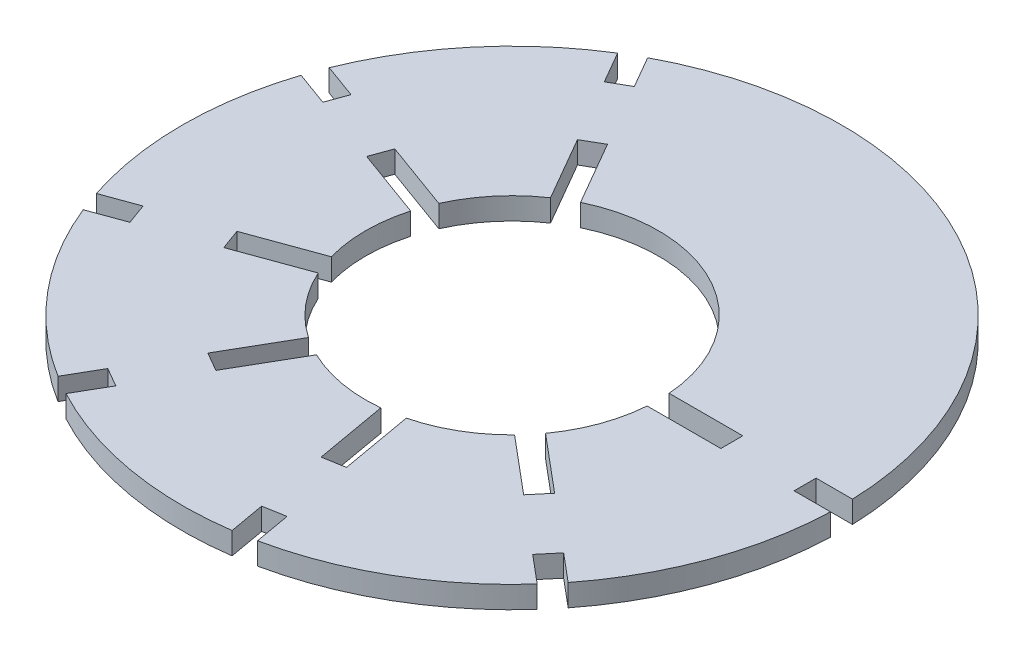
ISO-10303-21;
HEADER;
FILE_DESCRIPTION(('STEP AP214'),'2;1');
FILE_NAME('part.step','',(''),(''),'','','');
FILE_SCHEMA(('AUTOMOTIVE_DESIGN { 1 0 10303 214 1 1 1 1 }'));
ENDSEC;
DATA;
#1=APPLICATION_CONTEXT('core data for automotive mechanical design processes');
#2=APPLICATION_PROTOCOL_DEFINITION('international standard','automotive_design',2000,#1);
#3=PRODUCT_CONTEXT('',#1,'mechanical');
#4=PRODUCT('Part','Part','',(#3));
#5=PRODUCT_RELATED_PRODUCT_CATEGORY('part','',(#4));
#6=PRODUCT_DEFINITION_FORMATION('','',#4);
#7=PRODUCT_DEFINITION_CONTEXT('part definition',#1,'design');
#8=PRODUCT_DEFINITION('design','',#6,#7);
#9=PRODUCT_DEFINITION_SHAPE('','',#8);
#10=(LENGTH_UNIT() NAMED_UNIT(*) SI_UNIT(.MILLI.,.METRE.));
#11=(NAMED_UNIT(*) PLANE_ANGLE_UNIT() SI_UNIT($,.RADIAN.));
#12=(NAMED_UNIT(*) SI_UNIT($,.STERADIAN.) SOLID_ANGLE_UNIT());
#13=UNCERTAINTY_MEASURE_WITH_UNIT(LENGTH_MEASURE(1.E-05),#10,'distance_accuracy_value','');
#14=(GEOMETRIC_REPRESENTATION_CONTEXT(3) GLOBAL_UNCERTAINTY_ASSIGNED_CONTEXT((#13)) GLOBAL_UNIT_ASSIGNED_CONTEXT((#10,
#11,#12)) REPRESENTATION_CONTEXT('',''));
#15=CARTESIAN_POINT('',(0.,0.,0.));
#16=DIRECTION('',(0.,0.,1.));
#17=DIRECTION('',(1.,0.,0.));
#18=AXIS2_PLACEMENT_3D('',#15,#16,#17);
#19=CARTESIAN_POINT('',(0.,15.,0.));
#20=DIRECTION('',(0.,1.,0.));
#21=DIRECTION('',(0.,0.,1.));
#22=AXIS2_PLACEMENT_3D('',#19,#20,#21);
#23=PLANE('',#22);
#24=DIRECTION('',(0.342020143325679,0.,-0.939692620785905));
#25=VECTOR('',#24,1.);
#26=CARTESIAN_POINT('',(-190.503675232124,15.,-61.3563340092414));
#27=LINE('',#26,#25);
#28=CARTESIAN_POINT('',(-190.503675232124,15.,-61.3563340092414));
#29=VERTEX_POINT('',#28);
#30=CARTESIAN_POINT('',(-185.373373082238,15.,-75.4517233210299));
#31=VERTEX_POINT('',#30);
#32=EDGE_CURVE('E509',#29,#31,#27,.T.);
#33=ORIENTED_EDGE('',*,*,#32,.F.);
#34=DIRECTION('',(-0.939692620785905,0.,-0.342020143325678));
#35=VECTOR('',#34,1.);
#36=CARTESIAN_POINT('',(-190.503675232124,15.,-61.3563340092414));
#37=LINE('',#36,#35);
#38=CARTESIAN_POINT('',(-213.878496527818,15.,-69.864073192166));
#39=VERTEX_POINT('',#38);
#40=EDGE_CURVE('E527',#29,#39,#37,.T.);
#41=ORIENTED_EDGE('',*,*,#40,.T.);
#42=CARTESIAN_POINT('',(0.,15.,0.));
#43=DIRECTION('',(0.,1.,0.));
#44=DIRECTION('',(0.,0.,1.));
#45=AXIS2_PLACEMENT_3D('',#42,#43,#44);
#46=CIRCLE('',#45,225.);
#47=CARTESIAN_POINT('',(-213.878496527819,15.,69.8640731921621));
#48=VERTEX_POINT('',#47);
#49=EDGE_CURVE('E771',#39,#48,#46,.T.);
#50=ORIENTED_EDGE('',*,*,#49,.T.);
#51=DIRECTION('',(-0.939692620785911,0.,0.342020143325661));
#52=VECTOR('',#51,1.);
#53=CARTESIAN_POINT('',(-190.503675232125,15.,61.3563340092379));
#54=LINE('',#53,#52);
#55=CARTESIAN_POINT('',(-190.503675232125,15.,61.3563340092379));
#56=VERTEX_POINT('',#55);
#57=EDGE_CURVE('E431',#56,#48,#54,.T.);
#58=ORIENTED_EDGE('',*,*,#57,.F.);
#59=DIRECTION('',(-0.342020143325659,0.,-0.939692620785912));
#60=VECTOR('',#59,1.);
#61=CARTESIAN_POINT('',(-185.37337308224,15.,75.4517233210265));
#62=LINE('',#61,#60);
#63=CARTESIAN_POINT('',(-185.37337308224,15.,75.4517233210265));
#64=VERTEX_POINT('',#63);
#65=EDGE_CURVE('E395',#64,#56,#62,.T.);
#66=ORIENTED_EDGE('',*,*,#65,.F.);
#67=DIRECTION('',(-0.939692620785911,0.,0.342020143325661));
#68=VECTOR('',#67,1.);
#69=CARTESIAN_POINT('',(-185.37337308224,15.,75.4517233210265));
#70=LINE('',#69,#68);
#71=CARTESIAN_POINT('',(-208.748194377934,15.,83.9594625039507));
#72=VERTEX_POINT('',#71);
#73=EDGE_CURVE('E428',#64,#72,#70,.T.);
#74=ORIENTED_EDGE('',*,*,#73,.T.);
#75=CARTESIAN_POINT('',(-118.932673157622,15.,190.997432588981));
#76=VERTEX_POINT('',#75);
#77=EDGE_CURVE('E773',#72,#76,#46,.T.);
#78=ORIENTED_EDGE('',*,*,#77,.T.);
#79=DIRECTION('',(-0.500000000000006,0.,0.866025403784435));
#80=VECTOR('',#79,1.);
#81=CARTESIAN_POINT('',(-106.495190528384,15.,169.455080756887));
#82=LINE('',#81,#80);
#83=CARTESIAN_POINT('',(-106.495190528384,15.,169.455080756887));
#84=VERTEX_POINT('',#83);
#85=EDGE_CURVE('E405',#84,#76,#82,.T.);
#86=ORIENTED_EDGE('',*,*,#85,.F.);
#87=DIRECTION('',(-0.866025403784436,0.,-0.500000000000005));
#88=VECTOR('',#87,1.);
#89=CARTESIAN_POINT('',(-93.5048094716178,15.,176.955080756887));
#90=LINE('',#89,#88);
#91=CARTESIAN_POINT('',(-93.5048094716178,15.,176.955080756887));
#92=VERTEX_POINT('',#91);
#93=EDGE_CURVE('E388',#92,#84,#90,.T.);
#94=ORIENTED_EDGE('',*,*,#93,.F.);
#95=DIRECTION('',(-0.500000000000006,0.,0.866025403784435));
#96=VECTOR('',#95,1.);
#97=CARTESIAN_POINT('',(-93.5048094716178,15.,176.955080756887));
#98=LINE('',#97,#96);
#99=CARTESIAN_POINT('',(-105.942292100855,15.,198.497432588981));
#100=VERTEX_POINT('',#99);
#101=EDGE_CURVE('E398',#92,#100,#98,.T.);
#102=ORIENTED_EDGE('',*,*,#101,.T.);
#103=CARTESIAN_POINT('',(31.6630697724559,15.,222.760970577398));
#104=VERTEX_POINT('',#103);
#105=EDGE_CURVE('E776',#100,#104,#46,.T.);
#106=ORIENTED_EDGE('',*,*,#105,.T.);
#107=DIRECTION('',(0.173648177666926,0.,0.984807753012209));
#108=VECTOR('',#107,1.);
#109=CARTESIAN_POINT('',(27.3435773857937,15.,198.263911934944));
#110=LINE('',#109,#108);
#111=CARTESIAN_POINT('',(27.3435773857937,15.,198.263911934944));
#112=VERTEX_POINT('',#111);
#113=EDGE_CURVE('E55',#112,#104,#110,.T.);
#114=ORIENTED_EDGE('',*,*,#113,.F.);
#115=DIRECTION('',(-0.984807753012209,0.,0.173648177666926));
#116=VECTOR('',#115,1.);
#117=CARTESIAN_POINT('',(42.1156936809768,15.,195.65918926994));
#118=LINE('',#117,#116);
#119=CARTESIAN_POINT('',(42.1156936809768,15.,195.65918926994));
#120=VERTEX_POINT('',#119);
#121=EDGE_CURVE('E588',#120,#112,#118,.T.);
#122=ORIENTED_EDGE('',*,*,#121,.F.);
#123=DIRECTION('',(0.173648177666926,0.,0.984807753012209));
#124=VECTOR('',#123,1.);
#125=CARTESIAN_POINT('',(42.1156936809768,15.,195.65918926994));
#126=LINE('',#125,#124);
#127=CARTESIAN_POINT('',(46.435186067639,15.,220.156247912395));
#128=VERTEX_POINT('',#127);
#129=EDGE_CURVE('E608',#120,#128,#126,.T.);
#130=ORIENTED_EDGE('',*,*,#129,.T.);
#131=CARTESIAN_POINT('',(167.443310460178,15.,150.292174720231));
#132=VERTEX_POINT('',#131);
#133=EDGE_CURVE('E778',#128,#132,#46,.T.);
#134=ORIENTED_EDGE('',*,*,#133,.T.);
#135=DIRECTION('',(0.766044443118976,0.,0.642787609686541));
#136=VECTOR('',#135,1.);
#137=CARTESIAN_POINT('',(148.387981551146,15.,134.302855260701));
#138=LINE('',#137,#136);
#139=CARTESIAN_POINT('',(148.387981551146,15.,134.302855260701));
#140=VERTEX_POINT('',#139);
#141=EDGE_CURVE('E47',#140,#132,#138,.T.);
#142=ORIENTED_EDGE('',*,*,#141,.F.);
#143=DIRECTION('',(-0.642787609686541,0.,0.766044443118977));
#144=VECTOR('',#143,1.);
#145=CARTESIAN_POINT('',(158.029795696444,15.,122.812188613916));
#146=LINE('',#145,#144);
#147=CARTESIAN_POINT('',(158.029795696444,15.,122.812188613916));
#148=VERTEX_POINT('',#147);
#149=EDGE_CURVE('E547',#148,#140,#146,.T.);
#150=ORIENTED_EDGE('',*,*,#149,.F.);
#151=DIRECTION('',(0.766044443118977,0.,0.642787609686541));
#152=VECTOR('',#151,1.);
#153=CARTESIAN_POINT('',(158.029795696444,15.,122.812188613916));
#154=LINE('',#153,#152);
#155=CARTESIAN_POINT('',(177.085124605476,15.,138.801508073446));
#156=VERTEX_POINT('',#155);
#157=EDGE_CURVE('E569',#148,#156,#154,.T.);
#158=ORIENTED_EDGE('',*,*,#157,.T.);
#159=CARTESIAN_POINT('',(224.874965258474,15.,7.5));
#160=VERTEX_POINT('',#159);
#161=EDGE_CURVE('E692',#156,#160,#46,.T.);
#162=ORIENTED_EDGE('',*,*,#161,.T.);
#163=DIRECTION('',(1.,0.,0.));
#164=VECTOR('',#163,1.);
#165=CARTESIAN_POINT('',(200.,15.,7.5));
#166=LINE('',#165,#164);
#167=CARTESIAN_POINT('',(200.,15.,7.5));
#168=VERTEX_POINT('',#167);
#169=EDGE_CURVE('E669',#168,#160,#166,.T.);
#170=ORIENTED_EDGE('',*,*,#169,.F.);
#171=DIRECTION('',(0.,0.,1.));
#172=VECTOR('',#171,1.);
#173=CARTESIAN_POINT('',(200.,15.,-7.5));
#174=LINE('',#173,#172);
#175=CARTESIAN_POINT('',(200.,15.,-7.5));
#176=VERTEX_POINT('',#175);
#177=EDGE_CURVE('E557',#176,#168,#174,.T.);
#178=ORIENTED_EDGE('',*,*,#177,.F.);
#179=DIRECTION('',(1.,0.,0.));
#180=VECTOR('',#179,1.);
#181=CARTESIAN_POINT('',(200.,15.,-7.5));
#182=LINE('',#181,#180);
#183=CARTESIAN_POINT('',(224.874965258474,15.,-7.5));
#184=VERTEX_POINT('',#183);
#185=EDGE_CURVE('E661',#176,#184,#182,.T.);
#186=ORIENTED_EDGE('',*,*,#185,.T.);
#187=CARTESIAN_POINT('',(-105.942292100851,15.,-198.497432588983));
#188=VERTEX_POINT('',#187);
#189=EDGE_CURVE('E687',#184,#188,#46,.T.);
#190=ORIENTED_EDGE('',*,*,#189,.T.);
#191=DIRECTION('',(-0.499999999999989,0.,-0.866025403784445));
#192=VECTOR('',#191,1.);
#193=CARTESIAN_POINT('',(-93.5048094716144,15.,-176.955080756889));
#194=LINE('',#193,#192);
#195=CARTESIAN_POINT('',(-93.5048094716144,15.,-176.955080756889));
#196=VERTEX_POINT('',#195);
#197=EDGE_CURVE('E492',#196,#188,#194,.T.);
#198=ORIENTED_EDGE('',*,*,#197,.F.);
#199=DIRECTION('',(0.866025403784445,0.,-0.499999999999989));
#200=VECTOR('',#199,1.);
#201=CARTESIAN_POINT('',(-106.495190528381,15.,-169.455080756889));
#202=LINE('',#201,#200);
#203=CARTESIAN_POINT('',(-106.495190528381,15.,-169.455080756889));
#204=VERTEX_POINT('',#203);
#205=EDGE_CURVE('E468',#204,#196,#202,.T.);
#206=ORIENTED_EDGE('',*,*,#205,.F.);
#207=DIRECTION('',(-0.499999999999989,0.,-0.866025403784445));
#208=VECTOR('',#207,1.);
#209=CARTESIAN_POINT('',(-106.495190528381,15.,-169.455080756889));
#210=LINE('',#209,#208);
#211=CARTESIAN_POINT('',(-118.932673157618,15.,-190.997432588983));
#212=VERTEX_POINT('',#211);
#213=EDGE_CURVE('E489',#204,#212,#210,.T.);
#214=ORIENTED_EDGE('',*,*,#213,.T.);
#215=CARTESIAN_POINT('',(-208.748194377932,15.,-83.9594625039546));
#216=VERTEX_POINT('',#215);
#217=EDGE_CURVE('E691',#212,#216,#46,.T.);
#218=ORIENTED_EDGE('',*,*,#217,.T.);
#219=DIRECTION('',(-0.939692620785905,0.,-0.342020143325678));
#220=VECTOR('',#219,1.);
#221=CARTESIAN_POINT('',(-185.373373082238,15.,-75.4517233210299));
#222=LINE('',#221,#220);
#223=EDGE_CURVE('E530',#31,#216,#222,.T.);
#224=ORIENTED_EDGE('',*,*,#223,.F.);
#225=EDGE_LOOP('',(#33,#41,#50,#58,#66,#74,#78,#86,#94,#102,#106,#114,#122,#130,#134,#142,#150,
#158,#162,#170,#178,#186,#190,#198,#206,#214,#218,#224));
#226=FACE_BOUND('',#225,.T.);
#227=CARTESIAN_POINT('',(0.,15.,0.));
#228=DIRECTION('',(0.,1.,0.));
#229=DIRECTION('',(0.,0.,1.));
#230=AXIS2_PLACEMENT_3D('',#227,#228,#229);
#231=CIRCLE('',#230,100.);
#232=CARTESIAN_POINT('',(-96.269751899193,15.,-27.0579908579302));
#233=VERTEX_POINT('',#232);
#234=CARTESIAN_POINT('',(-96.2697518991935,15.,27.0579908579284));
#235=VERTEX_POINT('',#234);
#236=EDGE_CURVE('E815',#233,#235,#231,.T.);
#237=ORIENTED_EDGE('',*,*,#236,.F.);
#238=DIRECTION('',(-0.939692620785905,0.,-0.342020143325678));
#239=VECTOR('',#238,1.);
#240=CARTESIAN_POINT('',(-91.8359500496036,15.,-25.4442189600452));
#241=LINE('',#240,#239);
#242=CARTESIAN_POINT('',(-143.519044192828,15.,-44.2553268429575));
#243=VERTEX_POINT('',#242);
#244=EDGE_CURVE('E510',#233,#243,#241,.T.);
#245=ORIENTED_EDGE('',*,*,#244,.T.);
#246=DIRECTION('',(0.342020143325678,0.,-0.939692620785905));
#247=VECTOR('',#246,1.);
#248=CARTESIAN_POINT('',(-143.519044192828,15.,-44.2553268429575));
#249=LINE('',#248,#247);
#250=CARTESIAN_POINT('',(-138.388742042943,15.,-58.350716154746));
#251=VERTEX_POINT('',#250);
#252=EDGE_CURVE('E513',#243,#251,#249,.T.);
#253=ORIENTED_EDGE('',*,*,#252,.T.);
#254=DIRECTION('',(-0.939692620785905,0.,-0.342020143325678));
#255=VECTOR('',#254,1.);
#256=CARTESIAN_POINT('',(-86.7056478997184,15.,-39.5396082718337));
#257=LINE('',#256,#255);
#258=CARTESIAN_POINT('',(-91.1394497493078,15.,-41.1533801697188));
#259=VERTEX_POINT('',#258);
#260=EDGE_CURVE('E448',#259,#251,#257,.T.);
#261=ORIENTED_EDGE('',*,*,#260,.F.);
#262=CARTESIAN_POINT('',(-56.3543672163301,15.,-82.6086272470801));
#263=VERTEX_POINT('',#262);
#264=EDGE_CURVE('E810',#263,#259,#231,.T.);
#265=ORIENTED_EDGE('',*,*,#264,.F.);
#266=DIRECTION('',(-0.499999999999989,0.,-0.866025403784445));
#267=VECTOR('',#266,1.);
#268=CARTESIAN_POINT('',(-53.9951905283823,15.,-78.5224133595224));
#269=LINE('',#268,#267);
#270=CARTESIAN_POINT('',(-81.4951905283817,15.,-126.153810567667));
#271=VERTEX_POINT('',#270);
#272=EDGE_CURVE('E469',#263,#271,#269,.T.);
#273=ORIENTED_EDGE('',*,*,#272,.T.);
#274=DIRECTION('',(0.866025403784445,0.,-0.499999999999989));
#275=VECTOR('',#274,1.);
#276=CARTESIAN_POINT('',(-81.4951905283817,15.,-126.153810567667));
#277=LINE('',#276,#275);
#278=CARTESIAN_POINT('',(-68.504809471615,15.,-133.653810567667));
#279=VERTEX_POINT('',#278);
#280=EDGE_CURVE('E472',#271,#279,#277,.T.);
#281=ORIENTED_EDGE('',*,*,#280,.T.);
#282=DIRECTION('',(-0.499999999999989,0.,-0.866025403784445));
#283=VECTOR('',#282,1.);
#284=CARTESIAN_POINT('',(-41.0048094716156,15.,-86.0224133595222));
#285=LINE('',#284,#283);
#286=CARTESIAN_POINT('',(-43.3639861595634,15.,-90.1086272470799));
#287=VERTEX_POINT('',#286);
#288=EDGE_CURVE('E476',#287,#279,#285,.T.);
#289=ORIENTED_EDGE('',*,*,#288,.F.);
#290=CARTESIAN_POINT('',(99.7183533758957,15.,-7.5));
#291=VERTEX_POINT('',#290);
#292=EDGE_CURVE('E805',#291,#287,#231,.T.);
#293=ORIENTED_EDGE('',*,*,#292,.F.);
#294=DIRECTION('',(1.,0.,0.));
#295=VECTOR('',#294,1.);
#296=CARTESIAN_POINT('',(95.,15.,-7.5));
#297=LINE('',#296,#295);
#298=CARTESIAN_POINT('',(150.,15.,-7.5));
#299=VERTEX_POINT('',#298);
#300=EDGE_CURVE('E548',#291,#299,#297,.T.);
#301=ORIENTED_EDGE('',*,*,#300,.T.);
#302=DIRECTION('',(0.,0.,1.));
#303=VECTOR('',#302,1.);
#304=CARTESIAN_POINT('',(150.,15.,-7.5));
#305=LINE('',#304,#303);
#306=CARTESIAN_POINT('',(150.,15.,7.5));
#307=VERTEX_POINT('',#306);
#308=EDGE_CURVE('E551',#299,#307,#305,.T.);
#309=ORIENTED_EDGE('',*,*,#308,.T.);
#310=DIRECTION('',(1.,0.,0.));
#311=VECTOR('',#310,1.);
#312=CARTESIAN_POINT('',(95.,15.,7.5));
#313=LINE('',#312,#311);
#314=CARTESIAN_POINT('',(99.7183533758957,15.,7.5));
#315=VERTEX_POINT('',#314);
#316=EDGE_CURVE('E555',#315,#307,#313,.T.);
#317=ORIENTED_EDGE('',*,*,#316,.F.);
#318=CARTESIAN_POINT('',(81.2095975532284,15.,58.3523886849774));
#319=VERTEX_POINT('',#318);
#320=EDGE_CURVE('E800',#319,#315,#231,.T.);
#321=ORIENTED_EDGE('',*,*,#320,.F.);
#322=DIRECTION('',(0.766044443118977,0.,0.642787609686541));
#323=VECTOR('',#322,1.);
#324=CARTESIAN_POINT('',(77.5951291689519,15.,55.3194895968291));
#325=LINE('',#324,#323);
#326=CARTESIAN_POINT('',(119.727573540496,15.,90.6728081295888));
#327=VERTEX_POINT('',#326);
#328=EDGE_CURVE('E589',#319,#327,#325,.T.);
#329=ORIENTED_EDGE('',*,*,#328,.T.);
#330=DIRECTION('',(-0.64278760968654,0.,0.766044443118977));
#331=VECTOR('',#330,1.);
#332=CARTESIAN_POINT('',(119.727573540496,15.,90.6728081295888));
#333=LINE('',#332,#331);
#334=CARTESIAN_POINT('',(110.085759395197,15.,102.163474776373));
#335=VERTEX_POINT('',#334);
#336=EDGE_CURVE('E592',#327,#335,#333,.T.);
#337=ORIENTED_EDGE('',*,*,#336,.T.);
#338=DIRECTION('',(0.766044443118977,0.,0.642787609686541));
#339=VECTOR('',#338,1.);
#340=CARTESIAN_POINT('',(67.9533150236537,15.,66.8101562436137));
#341=LINE('',#340,#339);
#342=CARTESIAN_POINT('',(71.5677834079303,15.,69.8430553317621));
#343=VERTEX_POINT('',#342);
#344=EDGE_CURVE('E568',#343,#335,#341,.T.);
#345=ORIENTED_EDGE('',*,*,#344,.F.);
#346=CARTESIAN_POINT('',(24.7019684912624,15.,96.9010461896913));
#347=VERTEX_POINT('',#346);
#348=EDGE_CURVE('E683',#347,#343,#231,.T.);
#349=ORIENTED_EDGE('',*,*,#348,.F.);
#350=DIRECTION('',(0.173648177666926,0.,0.984807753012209));
#351=VECTOR('',#350,1.);
#352=CARTESIAN_POINT('',(23.8826350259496,15.,92.2543752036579));
#353=LINE('',#352,#351);
#354=CARTESIAN_POINT('',(33.4332847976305,15.,146.418801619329));
#355=VERTEX_POINT('',#354);
#356=EDGE_CURVE('E628',#347,#355,#353,.T.);
#357=ORIENTED_EDGE('',*,*,#356,.T.);
#358=DIRECTION('',(-0.984807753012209,0.,0.173648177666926));
#359=VECTOR('',#358,1.);
#360=CARTESIAN_POINT('',(33.4332847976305,15.,146.418801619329));
#361=LINE('',#360,#359);
#362=CARTESIAN_POINT('',(18.6611685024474,15.,149.023524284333));
#363=VERTEX_POINT('',#362);
#364=EDGE_CURVE('E631',#355,#363,#361,.T.);
#365=ORIENTED_EDGE('',*,*,#364,.T.);
#366=DIRECTION('',(0.173648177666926,0.,0.984807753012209));
#367=VECTOR('',#366,1.);
#368=CARTESIAN_POINT('',(9.11051873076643,15.,94.8590978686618));
#369=LINE('',#368,#367);
#370=CARTESIAN_POINT('',(9.9298521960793,15.,99.5057688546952));
#371=VERTEX_POINT('',#370);
#372=EDGE_CURVE('E607',#371,#363,#369,.T.);
#373=ORIENTED_EDGE('',*,*,#372,.F.);
#374=CARTESIAN_POINT('',(-43.3639861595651,15.,90.1086272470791));
#375=VERTEX_POINT('',#374);
#376=EDGE_CURVE('E678',#375,#371,#231,.T.);
#377=ORIENTED_EDGE('',*,*,#376,.F.);
#378=DIRECTION('',(-0.500000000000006,0.,0.866025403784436));
#379=VECTOR('',#378,1.);
#380=CARTESIAN_POINT('',(-41.0048094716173,15.,86.0224133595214));
#381=LINE('',#380,#379);
#382=CARTESIAN_POINT('',(-68.5048094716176,15.,133.653810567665));
#383=VERTEX_POINT('',#382);
#384=EDGE_CURVE('E644',#375,#383,#381,.T.);
#385=ORIENTED_EDGE('',*,*,#384,.T.);
#386=DIRECTION('',(-0.866025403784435,0.,-0.500000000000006));
#387=VECTOR('',#386,1.);
#388=CARTESIAN_POINT('',(-68.5048094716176,15.,133.653810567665));
#389=LINE('',#388,#387);
#390=CARTESIAN_POINT('',(-81.4951905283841,15.,126.153810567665));
#391=VERTEX_POINT('',#390);
#392=EDGE_CURVE('E647',#383,#391,#389,.T.);
#393=ORIENTED_EDGE('',*,*,#392,.T.);
#394=DIRECTION('',(-0.500000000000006,0.,0.866025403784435));
#395=VECTOR('',#394,1.);
#396=CARTESIAN_POINT('',(-53.9951905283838,15.,78.5224133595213));
#397=LINE('',#396,#395);
#398=CARTESIAN_POINT('',(-56.3543672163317,15.,82.608627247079));
#399=VERTEX_POINT('',#398);
#400=EDGE_CURVE('E627',#399,#391,#397,.T.);
#401=ORIENTED_EDGE('',*,*,#400,.F.);
#402=CARTESIAN_POINT('',(-91.1394497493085,15.,41.1533801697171));
#403=VERTEX_POINT('',#402);
#404=EDGE_CURVE('E681',#403,#399,#231,.T.);
#405=ORIENTED_EDGE('',*,*,#404,.F.);
#406=DIRECTION('',(-0.939692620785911,0.,0.342020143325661));
#407=VECTOR('',#406,1.);
#408=CARTESIAN_POINT('',(-86.7056478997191,15.,39.5396082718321));
#409=LINE('',#408,#407);
#410=CARTESIAN_POINT('',(-138.388742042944,15.,58.3507161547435));
#411=VERTEX_POINT('',#410);
#412=EDGE_CURVE('E449',#403,#411,#409,.T.);
#413=ORIENTED_EDGE('',*,*,#412,.T.);
#414=DIRECTION('',(-0.342020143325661,0.,-0.939692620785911));
#415=VECTOR('',#414,1.);
#416=CARTESIAN_POINT('',(-138.388742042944,15.,58.3507161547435));
#417=LINE('',#416,#415);
#418=CARTESIAN_POINT('',(-143.519044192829,15.,44.2553268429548));
#419=VERTEX_POINT('',#418);
#420=EDGE_CURVE('E452',#411,#419,#417,.T.);
#421=ORIENTED_EDGE('',*,*,#420,.T.);
#422=DIRECTION('',(-0.939692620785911,0.,0.342020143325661));
#423=VECTOR('',#422,1.);
#424=CARTESIAN_POINT('',(-91.835950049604,15.,25.4442189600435));
#425=LINE('',#424,#423);
#426=EDGE_CURVE('E427',#235,#419,#425,.T.);
#427=ORIENTED_EDGE('',*,*,#426,.F.);
#428=EDGE_LOOP('',(#237,#245,#253,#261,#265,#273,#281,#289,#293,#301,#309,#317,#321,#329,#337,
#345,#349,#357,#365,#373,#377,#385,#393,#401,#405,#413,#421,#427));
#429=FACE_BOUND('',#428,.T.);
#430=ADVANCED_FACE('F32',(#226,#429),#23,.T.);
#431=CARTESIAN_POINT('',(0.,0.,0.));
#432=DIRECTION('',(0.,1.,0.));
#433=DIRECTION('',(0.,0.,1.));
#434=AXIS2_PLACEMENT_3D('',#431,#432,#433);
#435=PLANE('',#434);
#436=DIRECTION('',(-0.939692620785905,0.,-0.342020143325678));
#437=VECTOR('',#436,1.);
#438=CARTESIAN_POINT('',(-190.503675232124,0.,-61.3563340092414));
#439=LINE('',#438,#437);
#440=CARTESIAN_POINT('',(-190.503675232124,0.,-61.3563340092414));
#441=VERTEX_POINT('',#440);
#442=CARTESIAN_POINT('',(-213.878496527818,0.,-69.864073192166));
#443=VERTEX_POINT('',#442);
#444=EDGE_CURVE('E525',#441,#443,#439,.T.);
#445=ORIENTED_EDGE('',*,*,#444,.F.);
#446=DIRECTION('',(0.342020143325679,0.,-0.939692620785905));
#447=VECTOR('',#446,1.);
#448=CARTESIAN_POINT('',(-190.503675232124,0.,-61.3563340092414));
#449=LINE('',#448,#447);
#450=CARTESIAN_POINT('',(-185.373373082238,0.,-75.4517233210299));
#451=VERTEX_POINT('',#450);
#452=EDGE_CURVE('E531',#441,#451,#449,.T.);
#453=ORIENTED_EDGE('',*,*,#452,.T.);
#454=DIRECTION('',(-0.939692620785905,0.,-0.342020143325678));
#455=VECTOR('',#454,1.);
#456=CARTESIAN_POINT('',(-185.373373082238,0.,-75.4517233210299));
#457=LINE('',#456,#455);
#458=CARTESIAN_POINT('',(-208.748194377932,0.,-83.9594625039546));
#459=VERTEX_POINT('',#458);
#460=EDGE_CURVE('E536',#451,#459,#457,.T.);
#461=ORIENTED_EDGE('',*,*,#460,.T.);
#462=CARTESIAN_POINT('',(0.,0.,0.));
#463=DIRECTION('',(0.,1.,0.));
#464=DIRECTION('',(0.,0.,1.));
#465=AXIS2_PLACEMENT_3D('',#462,#463,#464);
#466=CIRCLE('',#465,225.);
#467=CARTESIAN_POINT('',(-118.932673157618,0.,-190.997432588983));
#468=VERTEX_POINT('',#467);
#469=EDGE_CURVE('E696',#468,#459,#466,.T.);
#470=ORIENTED_EDGE('',*,*,#469,.F.);
#471=DIRECTION('',(-0.499999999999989,0.,-0.866025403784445));
#472=VECTOR('',#471,1.);
#473=CARTESIAN_POINT('',(-106.495190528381,0.,-169.455080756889));
#474=LINE('',#473,#472);
#475=CARTESIAN_POINT('',(-106.495190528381,0.,-169.455080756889));
#476=VERTEX_POINT('',#475);
#477=EDGE_CURVE('E486',#476,#468,#474,.T.);
#478=ORIENTED_EDGE('',*,*,#477,.F.);
#479=DIRECTION('',(0.866025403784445,0.,-0.499999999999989));
#480=VECTOR('',#479,1.);
#481=CARTESIAN_POINT('',(-106.495190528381,0.,-169.455080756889));
#482=LINE('',#481,#480);
#483=CARTESIAN_POINT('',(-93.5048094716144,0.,-176.955080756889));
#484=VERTEX_POINT('',#483);
#485=EDGE_CURVE('E493',#476,#484,#482,.T.);
#486=ORIENTED_EDGE('',*,*,#485,.T.);
#487=DIRECTION('',(-0.499999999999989,0.,-0.866025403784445));
#488=VECTOR('',#487,1.);
#489=CARTESIAN_POINT('',(-93.5048094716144,0.,-176.955080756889));
#490=LINE('',#489,#488);
#491=CARTESIAN_POINT('',(-105.942292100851,0.,-198.497432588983));
#492=VERTEX_POINT('',#491);
#493=EDGE_CURVE('E498',#484,#492,#490,.T.);
#494=ORIENTED_EDGE('',*,*,#493,.T.);
#495=CARTESIAN_POINT('',(224.874965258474,0.,-7.5));
#496=VERTEX_POINT('',#495);
#497=EDGE_CURVE('E693',#496,#492,#466,.T.);
#498=ORIENTED_EDGE('',*,*,#497,.F.);
#499=DIRECTION('',(1.,0.,0.));
#500=VECTOR('',#499,1.);
#501=CARTESIAN_POINT('',(200.,0.,-7.5));
#502=LINE('',#501,#500);
#503=CARTESIAN_POINT('',(200.,0.,-7.5));
#504=VERTEX_POINT('',#503);
#505=EDGE_CURVE('E664',#504,#496,#502,.T.);
#506=ORIENTED_EDGE('',*,*,#505,.F.);
#507=DIRECTION('',(0.,0.,1.));
#508=VECTOR('',#507,1.);
#509=CARTESIAN_POINT('',(200.,0.,-7.5));
#510=LINE('',#509,#508);
#511=CARTESIAN_POINT('',(200.,0.,7.5));
#512=VERTEX_POINT('',#511);
#513=EDGE_CURVE('E657',#504,#512,#510,.T.);
#514=ORIENTED_EDGE('',*,*,#513,.T.);
#515=DIRECTION('',(1.,0.,0.));
#516=VECTOR('',#515,1.);
#517=CARTESIAN_POINT('',(200.,0.,7.5));
#518=LINE('',#517,#516);
#519=CARTESIAN_POINT('',(224.874965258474,0.,7.5));
#520=VERTEX_POINT('',#519);
#521=EDGE_CURVE('E660',#512,#520,#518,.T.);
#522=ORIENTED_EDGE('',*,*,#521,.T.);
#523=CARTESIAN_POINT('',(177.085124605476,0.,138.801508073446));
#524=VERTEX_POINT('',#523);
#525=EDGE_CURVE('E697',#524,#520,#466,.T.);
#526=ORIENTED_EDGE('',*,*,#525,.F.);
#527=DIRECTION('',(0.766044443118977,0.,0.642787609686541));
#528=VECTOR('',#527,1.);
#529=CARTESIAN_POINT('',(158.029795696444,0.,122.812188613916));
#530=LINE('',#529,#528);
#531=CARTESIAN_POINT('',(158.029795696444,0.,122.812188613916));
#532=VERTEX_POINT('',#531);
#533=EDGE_CURVE('E565',#532,#524,#530,.T.);
#534=ORIENTED_EDGE('',*,*,#533,.F.);
#535=DIRECTION('',(-0.642787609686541,0.,0.766044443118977));
#536=VECTOR('',#535,1.);
#537=CARTESIAN_POINT('',(158.029795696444,0.,122.812188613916));
#538=LINE('',#537,#536);
#539=CARTESIAN_POINT('',(148.387981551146,0.,134.302855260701));
#540=VERTEX_POINT('',#539);
#541=EDGE_CURVE('E572',#532,#540,#538,.T.);
#542=ORIENTED_EDGE('',*,*,#541,.T.);
#543=DIRECTION('',(0.766044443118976,0.,0.642787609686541));
#544=VECTOR('',#543,1.);
#545=CARTESIAN_POINT('',(148.387981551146,0.,134.302855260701));
#546=LINE('',#545,#544);
#547=CARTESIAN_POINT('',(167.443310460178,0.,150.292174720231));
#548=VERTEX_POINT('',#547);
#549=EDGE_CURVE('E577',#540,#548,#546,.T.);
#550=ORIENTED_EDGE('',*,*,#549,.T.);
#551=CARTESIAN_POINT('',(46.435186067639,0.,220.156247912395));
#552=VERTEX_POINT('',#551);
#553=EDGE_CURVE('E796',#552,#548,#466,.T.);
#554=ORIENTED_EDGE('',*,*,#553,.F.);
#555=DIRECTION('',(0.173648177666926,0.,0.984807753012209));
#556=VECTOR('',#555,1.);
#557=CARTESIAN_POINT('',(42.1156936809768,0.,195.65918926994));
#558=LINE('',#557,#556);
#559=CARTESIAN_POINT('',(42.1156936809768,0.,195.65918926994));
#560=VERTEX_POINT('',#559);
#561=EDGE_CURVE('E604',#560,#552,#558,.T.);
#562=ORIENTED_EDGE('',*,*,#561,.F.);
#563=DIRECTION('',(-0.984807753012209,0.,0.173648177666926));
#564=VECTOR('',#563,1.);
#565=CARTESIAN_POINT('',(42.1156936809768,0.,195.65918926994));
#566=LINE('',#565,#564);
#567=CARTESIAN_POINT('',(27.3435773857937,0.,198.263911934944));
#568=VERTEX_POINT('',#567);
#569=EDGE_CURVE('E611',#560,#568,#566,.T.);
#570=ORIENTED_EDGE('',*,*,#569,.T.);
#571=DIRECTION('',(0.173648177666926,0.,0.984807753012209));
#572=VECTOR('',#571,1.);
#573=CARTESIAN_POINT('',(27.3435773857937,0.,198.263911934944));
#574=LINE('',#573,#572);
#575=CARTESIAN_POINT('',(31.6630697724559,0.,222.760970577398));
#576=VERTEX_POINT('',#575);
#577=EDGE_CURVE('E616',#568,#576,#574,.T.);
#578=ORIENTED_EDGE('',*,*,#577,.T.);
#579=CARTESIAN_POINT('',(-105.942292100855,0.,198.497432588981));
#580=VERTEX_POINT('',#579);
#581=EDGE_CURVE('E798',#580,#576,#466,.T.);
#582=ORIENTED_EDGE('',*,*,#581,.F.);
#583=DIRECTION('',(-0.500000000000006,0.,0.866025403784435));
#584=VECTOR('',#583,1.);
#585=CARTESIAN_POINT('',(-93.5048094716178,0.,176.955080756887));
#586=LINE('',#585,#584);
#587=CARTESIAN_POINT('',(-93.5048094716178,0.,176.955080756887));
#588=VERTEX_POINT('',#587);
#589=EDGE_CURVE('E416',#588,#580,#586,.T.);
#590=ORIENTED_EDGE('',*,*,#589,.F.);
#591=DIRECTION('',(-0.866025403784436,0.,-0.500000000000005));
#592=VECTOR('',#591,1.);
#593=CARTESIAN_POINT('',(-93.5048094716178,0.,176.955080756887));
#594=LINE('',#593,#592);
#595=CARTESIAN_POINT('',(-106.495190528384,0.,169.455080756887));
#596=VERTEX_POINT('',#595);
#597=EDGE_CURVE('E391',#588,#596,#594,.T.);
#598=ORIENTED_EDGE('',*,*,#597,.T.);
#599=DIRECTION('',(-0.500000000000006,0.,0.866025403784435));
#600=VECTOR('',#599,1.);
#601=CARTESIAN_POINT('',(-106.495190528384,0.,169.455080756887));
#602=LINE('',#601,#600);
#603=CARTESIAN_POINT('',(-118.932673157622,0.,190.997432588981));
#604=VERTEX_POINT('',#603);
#605=EDGE_CURVE('E418',#596,#604,#602,.T.);
#606=ORIENTED_EDGE('',*,*,#605,.T.);
#607=CARTESIAN_POINT('',(-208.748194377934,0.,83.9594625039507));
#608=VERTEX_POINT('',#607);
#609=EDGE_CURVE('E1436',#608,#604,#466,.T.);
#610=ORIENTED_EDGE('',*,*,#609,.F.);
#611=DIRECTION('',(-0.939692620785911,0.,0.342020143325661));
#612=VECTOR('',#611,1.);
#613=CARTESIAN_POINT('',(-185.37337308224,0.,75.4517233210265));
#614=LINE('',#613,#612);
#615=CARTESIAN_POINT('',(-185.37337308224,0.,75.4517233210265));
#616=VERTEX_POINT('',#615);
#617=EDGE_CURVE('E424',#616,#608,#614,.T.);
#618=ORIENTED_EDGE('',*,*,#617,.F.);
#619=DIRECTION('',(-0.342020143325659,0.,-0.939692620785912));
#620=VECTOR('',#619,1.);
#621=CARTESIAN_POINT('',(-185.37337308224,0.,75.4517233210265));
#622=LINE('',#621,#620);
#623=CARTESIAN_POINT('',(-190.503675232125,0.,61.3563340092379));
#624=VERTEX_POINT('',#623);
#625=EDGE_CURVE('E432',#616,#624,#622,.T.);
#626=ORIENTED_EDGE('',*,*,#625,.T.);
#627=DIRECTION('',(-0.939692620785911,0.,0.342020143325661));
#628=VECTOR('',#627,1.);
#629=CARTESIAN_POINT('',(-190.503675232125,0.,61.3563340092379));
#630=LINE('',#629,#628);
#631=CARTESIAN_POINT('',(-213.878496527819,0.,69.8640731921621));
#632=VERTEX_POINT('',#631);
#633=EDGE_CURVE('E437',#624,#632,#630,.T.);
#634=ORIENTED_EDGE('',*,*,#633,.T.);
#635=EDGE_CURVE('E1434',#443,#632,#466,.T.);
#636=ORIENTED_EDGE('',*,*,#635,.F.);
#637=EDGE_LOOP('',(#445,#453,#461,#470,#478,#486,#494,#498,#506,#514,#522,#526,#534,#542,#550,
#554,#562,#570,#578,#582,#590,#598,#606,#610,#618,#626,#634,#636));
#638=FACE_BOUND('',#637,.T.);
#639=DIRECTION('',(-0.939692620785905,0.,-0.342020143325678));
#640=VECTOR('',#639,1.);
#641=CARTESIAN_POINT('',(-91.8359500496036,0.,-25.4442189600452));
#642=LINE('',#641,#640);
#643=CARTESIAN_POINT('',(-96.269751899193,0.,-27.0579908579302));
#644=VERTEX_POINT('',#643);
#645=CARTESIAN_POINT('',(-143.519044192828,0.,-44.2553268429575));
#646=VERTEX_POINT('',#645);
#647=EDGE_CURVE('E506',#644,#646,#642,.T.);
#648=ORIENTED_EDGE('',*,*,#647,.F.);
#649=CARTESIAN_POINT('',(0.,0.,0.));
#650=DIRECTION('',(0.,1.,0.));
#651=DIRECTION('',(0.,0.,1.));
#652=AXIS2_PLACEMENT_3D('',#649,#650,#651);
#653=CIRCLE('',#652,100.);
#654=CARTESIAN_POINT('',(-96.2697518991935,0.,27.0579908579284));
#655=VERTEX_POINT('',#654);
#656=EDGE_CURVE('E846',#644,#655,#653,.T.);
#657=ORIENTED_EDGE('',*,*,#656,.T.);
#658=DIRECTION('',(-0.939692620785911,0.,0.342020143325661));
#659=VECTOR('',#658,1.);
#660=CARTESIAN_POINT('',(-91.835950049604,0.,25.4442189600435));
#661=LINE('',#660,#659);
#662=CARTESIAN_POINT('',(-143.519044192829,0.,44.2553268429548));
#663=VERTEX_POINT('',#662);
#664=EDGE_CURVE('E453',#655,#663,#661,.T.);
#665=ORIENTED_EDGE('',*,*,#664,.T.);
#666=DIRECTION('',(-0.342020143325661,0.,-0.939692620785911));
#667=VECTOR('',#666,1.);
#668=CARTESIAN_POINT('',(-138.388742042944,0.,58.3507161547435));
#669=LINE('',#668,#667);
#670=CARTESIAN_POINT('',(-138.388742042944,0.,58.3507161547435));
#671=VERTEX_POINT('',#670);
#672=EDGE_CURVE('E458',#671,#663,#669,.T.);
#673=ORIENTED_EDGE('',*,*,#672,.F.);
#674=DIRECTION('',(-0.939692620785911,0.,0.342020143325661));
#675=VECTOR('',#674,1.);
#676=CARTESIAN_POINT('',(-86.7056478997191,0.,39.5396082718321));
#677=LINE('',#676,#675);
#678=CARTESIAN_POINT('',(-91.1394497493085,0.,41.1533801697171));
#679=VERTEX_POINT('',#678);
#680=EDGE_CURVE('E445',#679,#671,#677,.T.);
#681=ORIENTED_EDGE('',*,*,#680,.F.);
#682=CARTESIAN_POINT('',(-56.3543672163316,0.,82.608627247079));
#683=VERTEX_POINT('',#682);
#684=EDGE_CURVE('E686',#679,#683,#653,.T.);
#685=ORIENTED_EDGE('',*,*,#684,.T.);
#686=DIRECTION('',(-0.500000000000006,0.,0.866025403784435));
#687=VECTOR('',#686,1.);
#688=CARTESIAN_POINT('',(-53.9951905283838,0.,78.5224133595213));
#689=LINE('',#688,#687);
#690=CARTESIAN_POINT('',(-81.4951905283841,0.,126.153810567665));
#691=VERTEX_POINT('',#690);
#692=EDGE_CURVE('E648',#683,#691,#689,.T.);
#693=ORIENTED_EDGE('',*,*,#692,.T.);
#694=DIRECTION('',(-0.866025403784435,0.,-0.500000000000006));
#695=VECTOR('',#694,1.);
#696=CARTESIAN_POINT('',(-68.5048094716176,0.,133.653810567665));
#697=LINE('',#696,#695);
#698=CARTESIAN_POINT('',(-68.5048094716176,0.,133.653810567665));
#699=VERTEX_POINT('',#698);
#700=EDGE_CURVE('E653',#699,#691,#697,.T.);
#701=ORIENTED_EDGE('',*,*,#700,.F.);
#702=DIRECTION('',(-0.500000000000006,0.,0.866025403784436));
#703=VECTOR('',#702,1.);
#704=CARTESIAN_POINT('',(-41.0048094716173,0.,86.0224133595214));
#705=LINE('',#704,#703);
#706=CARTESIAN_POINT('',(-43.3639861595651,0.,90.1086272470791));
#707=VERTEX_POINT('',#706);
#708=EDGE_CURVE('E642',#707,#699,#705,.T.);
#709=ORIENTED_EDGE('',*,*,#708,.F.);
#710=CARTESIAN_POINT('',(9.9298521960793,0.,99.5057688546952));
#711=VERTEX_POINT('',#710);
#712=EDGE_CURVE('E676',#707,#711,#653,.T.);
#713=ORIENTED_EDGE('',*,*,#712,.T.);
#714=DIRECTION('',(0.173648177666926,0.,0.984807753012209));
#715=VECTOR('',#714,1.);
#716=CARTESIAN_POINT('',(9.11051873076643,0.,94.8590978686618));
#717=LINE('',#716,#715);
#718=CARTESIAN_POINT('',(18.6611685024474,0.,149.023524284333));
#719=VERTEX_POINT('',#718);
#720=EDGE_CURVE('E632',#711,#719,#717,.T.);
#721=ORIENTED_EDGE('',*,*,#720,.T.);
#722=DIRECTION('',(-0.984807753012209,0.,0.173648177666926));
#723=VECTOR('',#722,1.);
#724=CARTESIAN_POINT('',(33.4332847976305,0.,146.418801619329));
#725=LINE('',#724,#723);
#726=CARTESIAN_POINT('',(33.4332847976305,0.,146.418801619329));
#727=VERTEX_POINT('',#726);
#728=EDGE_CURVE('E637',#727,#719,#725,.T.);
#729=ORIENTED_EDGE('',*,*,#728,.F.);
#730=DIRECTION('',(0.173648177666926,0.,0.984807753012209));
#731=VECTOR('',#730,1.);
#732=CARTESIAN_POINT('',(23.8826350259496,0.,92.2543752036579));
#733=LINE('',#732,#731);
#734=CARTESIAN_POINT('',(24.7019684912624,0.,96.9010461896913));
#735=VERTEX_POINT('',#734);
#736=EDGE_CURVE('E624',#735,#727,#733,.T.);
#737=ORIENTED_EDGE('',*,*,#736,.F.);
#738=CARTESIAN_POINT('',(71.5677834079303,0.,69.8430553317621));
#739=VERTEX_POINT('',#738);
#740=EDGE_CURVE('E682',#735,#739,#653,.T.);
#741=ORIENTED_EDGE('',*,*,#740,.T.);
#742=DIRECTION('',(0.766044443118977,0.,0.642787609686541));
#743=VECTOR('',#742,1.);
#744=CARTESIAN_POINT('',(67.9533150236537,0.,66.8101562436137));
#745=LINE('',#744,#743);
#746=CARTESIAN_POINT('',(110.085759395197,0.,102.163474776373));
#747=VERTEX_POINT('',#746);
#748=EDGE_CURVE('E593',#739,#747,#745,.T.);
#749=ORIENTED_EDGE('',*,*,#748,.T.);
#750=DIRECTION('',(-0.64278760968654,0.,0.766044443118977));
#751=VECTOR('',#750,1.);
#752=CARTESIAN_POINT('',(119.727573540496,0.,90.6728081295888));
#753=LINE('',#752,#751);
#754=CARTESIAN_POINT('',(119.727573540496,0.,90.6728081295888));
#755=VERTEX_POINT('',#754);
#756=EDGE_CURVE('E598',#755,#747,#753,.T.);
#757=ORIENTED_EDGE('',*,*,#756,.F.);
#758=DIRECTION('',(0.766044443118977,0.,0.642787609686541));
#759=VECTOR('',#758,1.);
#760=CARTESIAN_POINT('',(77.5951291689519,0.,55.3194895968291));
#761=LINE('',#760,#759);
#762=CARTESIAN_POINT('',(81.2095975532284,0.,58.3523886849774));
#763=VERTEX_POINT('',#762);
#764=EDGE_CURVE('E585',#763,#755,#761,.T.);
#765=ORIENTED_EDGE('',*,*,#764,.F.);
#766=CARTESIAN_POINT('',(99.7183533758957,0.,7.5));
#767=VERTEX_POINT('',#766);
#768=EDGE_CURVE('E855',#763,#767,#653,.T.);
#769=ORIENTED_EDGE('',*,*,#768,.T.);
#770=DIRECTION('',(1.,0.,0.));
#771=VECTOR('',#770,1.);
#772=CARTESIAN_POINT('',(95.,0.,7.5));
#773=LINE('',#772,#771);
#774=CARTESIAN_POINT('',(150.,0.,7.5));
#775=VERTEX_POINT('',#774);
#776=EDGE_CURVE('E552',#767,#775,#773,.T.);
#777=ORIENTED_EDGE('',*,*,#776,.T.);
#778=DIRECTION('',(0.,0.,1.));
#779=VECTOR('',#778,1.);
#780=CARTESIAN_POINT('',(150.,0.,-7.5));
#781=LINE('',#780,#779);
#782=CARTESIAN_POINT('',(150.,0.,-7.5));
#783=VERTEX_POINT('',#782);
#784=EDGE_CURVE('E559',#783,#775,#781,.T.);
#785=ORIENTED_EDGE('',*,*,#784,.F.);
#786=DIRECTION('',(1.,0.,0.));
#787=VECTOR('',#786,1.);
#788=CARTESIAN_POINT('',(95.,0.,-7.5));
#789=LINE('',#788,#787);
#790=CARTESIAN_POINT('',(99.7183533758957,0.,-7.5));
#791=VERTEX_POINT('',#790);
#792=EDGE_CURVE('E544',#791,#783,#789,.T.);
#793=ORIENTED_EDGE('',*,*,#792,.F.);
#794=CARTESIAN_POINT('',(-43.3639861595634,0.,-90.1086272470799));
#795=VERTEX_POINT('',#794);
#796=EDGE_CURVE('E851',#791,#795,#653,.T.);
#797=ORIENTED_EDGE('',*,*,#796,.T.);
#798=DIRECTION('',(-0.499999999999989,0.,-0.866025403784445));
#799=VECTOR('',#798,1.);
#800=CARTESIAN_POINT('',(-41.0048094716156,0.,-86.0224133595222));
#801=LINE('',#800,#799);
#802=CARTESIAN_POINT('',(-68.504809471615,0.,-133.653810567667));
#803=VERTEX_POINT('',#802);
#804=EDGE_CURVE('E473',#795,#803,#801,.T.);
#805=ORIENTED_EDGE('',*,*,#804,.T.);
#806=DIRECTION('',(0.866025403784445,0.,-0.499999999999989));
#807=VECTOR('',#806,1.);
#808=CARTESIAN_POINT('',(-81.4951905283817,0.,-126.153810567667));
#809=LINE('',#808,#807);
#810=CARTESIAN_POINT('',(-81.4951905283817,0.,-126.153810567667));
#811=VERTEX_POINT('',#810);
#812=EDGE_CURVE('E480',#811,#803,#809,.T.);
#813=ORIENTED_EDGE('',*,*,#812,.F.);
#814=DIRECTION('',(-0.499999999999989,0.,-0.866025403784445));
#815=VECTOR('',#814,1.);
#816=CARTESIAN_POINT('',(-53.9951905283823,0.,-78.5224133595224));
#817=LINE('',#816,#815);
#818=CARTESIAN_POINT('',(-56.3543672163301,0.,-82.6086272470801));
#819=VERTEX_POINT('',#818);
#820=EDGE_CURVE('E465',#819,#811,#817,.T.);
#821=ORIENTED_EDGE('',*,*,#820,.F.);
#822=CARTESIAN_POINT('',(-91.1394497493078,0.,-41.1533801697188));
#823=VERTEX_POINT('',#822);
#824=EDGE_CURVE('E848',#819,#823,#653,.T.);
#825=ORIENTED_EDGE('',*,*,#824,.T.);
#826=DIRECTION('',(-0.939692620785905,0.,-0.342020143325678));
#827=VECTOR('',#826,1.);
#828=CARTESIAN_POINT('',(-86.7056478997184,0.,-39.5396082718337));
#829=LINE('',#828,#827);
#830=CARTESIAN_POINT('',(-138.388742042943,0.,-58.350716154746));
#831=VERTEX_POINT('',#830);
#832=EDGE_CURVE('E514',#823,#831,#829,.T.);
#833=ORIENTED_EDGE('',*,*,#832,.T.);
#834=DIRECTION('',(0.342020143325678,0.,-0.939692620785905));
#835=VECTOR('',#834,1.);
#836=CARTESIAN_POINT('',(-143.519044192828,0.,-44.2553268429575));
#837=LINE('',#836,#835);
#838=EDGE_CURVE('E519',#646,#831,#837,.T.);
#839=ORIENTED_EDGE('',*,*,#838,.F.);
#840=EDGE_LOOP('',(#648,#657,#665,#673,#681,#685,#693,#701,#709,#713,#721,#729,#737,#741,#749,
#757,#765,#769,#777,#785,#793,#797,#805,#813,#821,#825,#833,#839));
#841=FACE_BOUND('',#840,.T.);
#842=ADVANCED_FACE('F842',(#638,#841),#435,.F.);
#843=CARTESIAN_POINT('',(0.,15.,0.));
#844=DIRECTION('',(0.,-1.,0.));
#845=DIRECTION('',(0.,0.,-1.));
#846=AXIS2_PLACEMENT_3D('',#843,#844,#845);
#847=CYLINDRICAL_SURFACE('',#846,225.);
#848=DIRECTION('',(0.,-1.,0.));
#849=VECTOR('',#848,1.);
#850=CARTESIAN_POINT('',(-213.878496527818,15.,-69.864073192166));
#851=LINE('',#850,#849);
#852=EDGE_CURVE('E11',#443,#39,#851,.F.);
#853=ORIENTED_EDGE('',*,*,#852,.F.);
#854=ORIENTED_EDGE('',*,*,#635,.T.);
#855=DIRECTION('',(0.,-1.,0.));
#856=VECTOR('',#855,1.);
#857=CARTESIAN_POINT('',(-213.878496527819,15.,69.8640731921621));
#858=LINE('',#857,#856);
#859=EDGE_CURVE('E749',#632,#48,#858,.F.);
#860=ORIENTED_EDGE('',*,*,#859,.T.);
#861=ORIENTED_EDGE('',*,*,#49,.F.);
#862=EDGE_LOOP('',(#853,#854,#860,#861));
#863=FACE_BOUND('',#862,.T.);
#864=ADVANCED_FACE('F934',(#863),#847,.T.);
#865=ORIENTED_EDGE('',*,*,#469,.T.);
#866=DIRECTION('',(0.,-1.,0.));
#867=VECTOR('',#866,1.);
#868=CARTESIAN_POINT('',(-208.748194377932,15.,-83.9594625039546));
#869=LINE('',#868,#867);
#870=EDGE_CURVE('E40',#459,#216,#869,.F.);
#871=ORIENTED_EDGE('',*,*,#870,.T.);
#872=ORIENTED_EDGE('',*,*,#217,.F.);
#873=DIRECTION('',(0.,-1.,0.));
#874=VECTOR('',#873,1.);
#875=CARTESIAN_POINT('',(-118.932673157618,15.,-190.997432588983));
#876=LINE('',#875,#874);
#877=EDGE_CURVE('E757',#468,#212,#876,.F.);
#878=ORIENTED_EDGE('',*,*,#877,.F.);
#879=EDGE_LOOP('',(#865,#871,#872,#878));
#880=FACE_BOUND('',#879,.T.);
#881=ADVANCED_FACE('F763',(#880),#847,.T.);
#882=DIRECTION('',(0.,-1.,0.));
#883=VECTOR('',#882,1.);
#884=CARTESIAN_POINT('',(-208.748194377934,15.,83.9594625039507));
#885=LINE('',#884,#883);
#886=EDGE_CURVE('E752',#608,#72,#885,.F.);
#887=ORIENTED_EDGE('',*,*,#886,.F.);
#888=ORIENTED_EDGE('',*,*,#609,.T.);
#889=DIRECTION('',(0.,-1.,0.));
#890=VECTOR('',#889,1.);
#891=CARTESIAN_POINT('',(-118.932673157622,15.,190.997432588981));
#892=LINE('',#891,#890);
#893=EDGE_CURVE('E745',#604,#76,#892,.F.);
#894=ORIENTED_EDGE('',*,*,#893,.T.);
#895=ORIENTED_EDGE('',*,*,#77,.F.);
#896=EDGE_LOOP('',(#887,#888,#894,#895));
#897=FACE_BOUND('',#896,.T.);
#898=ADVANCED_FACE('F1314',(#897),#847,.T.);
#899=DIRECTION('',(0.,-1.,0.));
#900=VECTOR('',#899,1.);
#901=CARTESIAN_POINT('',(-105.942292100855,15.,198.497432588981));
#902=LINE('',#901,#900);
#903=EDGE_CURVE('E401',#580,#100,#902,.F.);
#904=ORIENTED_EDGE('',*,*,#903,.F.);
#905=ORIENTED_EDGE('',*,*,#581,.T.);
#906=DIRECTION('',(0.,-1.,0.));
#907=VECTOR('',#906,1.);
#908=CARTESIAN_POINT('',(31.6630697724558,15.,222.760970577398));
#909=LINE('',#908,#907);
#910=EDGE_CURVE('E741',#576,#104,#909,.F.);
#911=ORIENTED_EDGE('',*,*,#910,.T.);
#912=ORIENTED_EDGE('',*,*,#105,.F.);
#913=EDGE_LOOP('',(#904,#905,#911,#912));
#914=FACE_BOUND('',#913,.T.);
#915=ADVANCED_FACE('F1321',(#914),#847,.T.);
#916=DIRECTION('',(0.,-1.,0.));
#917=VECTOR('',#916,1.);
#918=CARTESIAN_POINT('',(46.435186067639,15.,220.156247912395));
#919=LINE('',#918,#917);
#920=EDGE_CURVE('E743',#552,#128,#919,.F.);
#921=ORIENTED_EDGE('',*,*,#920,.F.);
#922=ORIENTED_EDGE('',*,*,#553,.T.);
#923=DIRECTION('',(0.,-1.,0.));
#924=VECTOR('',#923,1.);
#925=CARTESIAN_POINT('',(167.443310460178,15.,150.292174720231));
#926=LINE('',#925,#924);
#927=EDGE_CURVE('E737',#548,#132,#926,.F.);
#928=ORIENTED_EDGE('',*,*,#927,.T.);
#929=ORIENTED_EDGE('',*,*,#133,.F.);
#930=EDGE_LOOP('',(#921,#922,#928,#929));
#931=FACE_BOUND('',#930,.T.);
#932=ADVANCED_FACE('F1329',(#931),#847,.T.);
#933=DIRECTION('',(0.,-1.,0.));
#934=VECTOR('',#933,1.);
#935=CARTESIAN_POINT('',(177.085124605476,15.,138.801508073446));
#936=LINE('',#935,#934);
#937=EDGE_CURVE('E739',#524,#156,#936,.F.);
#938=ORIENTED_EDGE('',*,*,#937,.F.);
#939=ORIENTED_EDGE('',*,*,#525,.T.);
#940=DIRECTION('',(0.,-1.,0.));
#941=VECTOR('',#940,1.);
#942=CARTESIAN_POINT('',(224.874965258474,15.,7.5));
#943=LINE('',#942,#941);
#944=EDGE_CURVE('E690',#520,#160,#943,.F.);
#945=ORIENTED_EDGE('',*,*,#944,.T.);
#946=ORIENTED_EDGE('',*,*,#161,.F.);
#947=EDGE_LOOP('',(#938,#939,#945,#946));
#948=FACE_BOUND('',#947,.T.);
#949=ADVANCED_FACE('F792',(#948),#847,.T.);
#950=CARTESIAN_POINT('',(0.,15.,0.));
#951=DIRECTION('',(0.,-1.,0.));
#952=DIRECTION('',(0.,0.,-1.));
#953=AXIS2_PLACEMENT_3D('',#950,#951,#952);
#954=CYLINDRICAL_SURFACE('',#953,100.);
#955=ORIENTED_EDGE('',*,*,#656,.F.);
#956=DIRECTION('',(0.,-1.,0.));
#957=VECTOR('',#956,1.);
#958=CARTESIAN_POINT('',(-96.269751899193,15.,-27.0579908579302));
#959=LINE('',#958,#957);
#960=EDGE_CURVE('E734',#644,#233,#959,.F.);
#961=ORIENTED_EDGE('',*,*,#960,.T.);
#962=ORIENTED_EDGE('',*,*,#236,.T.);
#963=DIRECTION('',(0.,-1.,0.));
#964=VECTOR('',#963,1.);
#965=CARTESIAN_POINT('',(-96.2697518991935,15.,27.0579908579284));
#966=LINE('',#965,#964);
#967=EDGE_CURVE('E722',#655,#235,#966,.F.);
#968=ORIENTED_EDGE('',*,*,#967,.F.);
#969=EDGE_LOOP('',(#955,#961,#962,#968));
#970=FACE_BOUND('',#969,.T.);
#971=ADVANCED_FACE('F909',(#970),#954,.F.);
#972=DIRECTION('',(0.,-1.,0.));
#973=VECTOR('',#972,1.);
#974=CARTESIAN_POINT('',(-91.1394497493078,15.,-41.1533801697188));
#975=LINE('',#974,#973);
#976=EDGE_CURVE('E732',#823,#259,#975,.F.);
#977=ORIENTED_EDGE('',*,*,#976,.F.);
#978=ORIENTED_EDGE('',*,*,#824,.F.);
#979=DIRECTION('',(0.,-1.,0.));
#980=VECTOR('',#979,1.);
#981=CARTESIAN_POINT('',(-56.3543672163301,15.,-82.6086272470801));
#982=LINE('',#981,#980);
#983=EDGE_CURVE('E729',#819,#263,#982,.F.);
#984=ORIENTED_EDGE('',*,*,#983,.T.);
#985=ORIENTED_EDGE('',*,*,#264,.T.);
#986=EDGE_LOOP('',(#977,#978,#984,#985));
#987=FACE_BOUND('',#986,.T.);
#988=ADVANCED_FACE('F898',(#987),#954,.F.);
#989=ORIENTED_EDGE('',*,*,#684,.F.);
#990=DIRECTION('',(0.,-1.,0.));
#991=VECTOR('',#990,1.);
#992=CARTESIAN_POINT('',(-91.1394497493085,15.,41.1533801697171));
#993=LINE('',#992,#991);
#994=EDGE_CURVE('E724',#679,#403,#993,.F.);
#995=ORIENTED_EDGE('',*,*,#994,.T.);
#996=ORIENTED_EDGE('',*,*,#404,.T.);
#997=DIRECTION('',(0.,-1.,0.));
#998=VECTOR('',#997,1.);
#999=CARTESIAN_POINT('',(-56.3543672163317,15.,82.608627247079));
#1000=LINE('',#999,#998);
#1001=EDGE_CURVE('E717',#683,#399,#1000,.F.);
#1002=ORIENTED_EDGE('',*,*,#1001,.F.);
#1003=EDGE_LOOP('',(#989,#995,#996,#1002));
#1004=FACE_BOUND('',#1003,.T.);
#1005=ADVANCED_FACE('F828',(#1004),#954,.F.);
#1006=ORIENTED_EDGE('',*,*,#712,.F.);
#1007=DIRECTION('',(0.,-1.,0.));
#1008=VECTOR('',#1007,1.);
#1009=CARTESIAN_POINT('',(-43.3639861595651,15.,90.1086272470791));
#1010=LINE('',#1009,#1008);
#1011=EDGE_CURVE('E719',#707,#375,#1010,.F.);
#1012=ORIENTED_EDGE('',*,*,#1011,.T.);
#1013=ORIENTED_EDGE('',*,*,#376,.T.);
#1014=DIRECTION('',(0.,-1.,0.));
#1015=VECTOR('',#1014,1.);
#1016=CARTESIAN_POINT('',(9.9298521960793,15.,99.5057688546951));
#1017=LINE('',#1016,#1015);
#1018=EDGE_CURVE('E712',#711,#371,#1017,.F.);
#1019=ORIENTED_EDGE('',*,*,#1018,.F.);
#1020=EDGE_LOOP('',(#1006,#1012,#1013,#1019));
#1021=FACE_BOUND('',#1020,.T.);
#1022=ADVANCED_FACE('F1361',(#1021),#954,.F.);
#1023=ORIENTED_EDGE('',*,*,#740,.F.);
#1024=DIRECTION('',(0.,-1.,0.));
#1025=VECTOR('',#1024,1.);
#1026=CARTESIAN_POINT('',(24.7019684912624,15.,96.9010461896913));
#1027=LINE('',#1026,#1025);
#1028=EDGE_CURVE('E714',#735,#347,#1027,.F.);
#1029=ORIENTED_EDGE('',*,*,#1028,.T.);
#1030=ORIENTED_EDGE('',*,*,#348,.T.);
#1031=DIRECTION('',(0.,-1.,0.));
#1032=VECTOR('',#1031,1.);
#1033=CARTESIAN_POINT('',(71.5677834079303,15.,69.8430553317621));
#1034=LINE('',#1033,#1032);
#1035=EDGE_CURVE('E707',#739,#343,#1034,.F.);
#1036=ORIENTED_EDGE('',*,*,#1035,.F.);
#1037=EDGE_LOOP('',(#1023,#1029,#1030,#1036));
#1038=FACE_BOUND('',#1037,.T.);
#1039=ADVANCED_FACE('F866',(#1038),#954,.F.);
#1040=ORIENTED_EDGE('',*,*,#768,.F.);
#1041=DIRECTION('',(0.,-1.,0.));
#1042=VECTOR('',#1041,1.);
#1043=CARTESIAN_POINT('',(81.2095975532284,15.,58.3523886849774));
#1044=LINE('',#1043,#1042);
#1045=EDGE_CURVE('E709',#763,#319,#1044,.F.);
#1046=ORIENTED_EDGE('',*,*,#1045,.T.);
#1047=ORIENTED_EDGE('',*,*,#320,.T.);
#1048=DIRECTION('',(0.,-1.,0.));
#1049=VECTOR('',#1048,1.);
#1050=CARTESIAN_POINT('',(99.7183533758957,15.,7.5));
#1051=LINE('',#1050,#1049);
#1052=EDGE_CURVE('E702',#767,#315,#1051,.F.);
#1053=ORIENTED_EDGE('',*,*,#1052,.F.);
#1054=EDGE_LOOP('',(#1040,#1046,#1047,#1053));
#1055=FACE_BOUND('',#1054,.T.);
#1056=ADVANCED_FACE('F876',(#1055),#954,.F.);
#1057=DIRECTION('',(0.,-1.,0.));
#1058=VECTOR('',#1057,1.);
#1059=CARTESIAN_POINT('',(-43.3639861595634,15.,-90.1086272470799));
#1060=LINE('',#1059,#1058);
#1061=EDGE_CURVE('E727',#795,#287,#1060,.F.);
#1062=ORIENTED_EDGE('',*,*,#1061,.F.);
#1063=ORIENTED_EDGE('',*,*,#796,.F.);
#1064=DIRECTION('',(0.,-1.,0.));
#1065=VECTOR('',#1064,1.);
#1066=CARTESIAN_POINT('',(99.7183533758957,15.,-7.5));
#1067=LINE('',#1066,#1065);
#1068=EDGE_CURVE('E704',#791,#291,#1067,.F.);
#1069=ORIENTED_EDGE('',*,*,#1068,.T.);
#1070=ORIENTED_EDGE('',*,*,#292,.T.);
#1071=EDGE_LOOP('',(#1062,#1063,#1069,#1070));
#1072=FACE_BOUND('',#1071,.T.);
#1073=ADVANCED_FACE('F887',(#1072),#954,.F.);
#1074=ORIENTED_EDGE('',*,*,#497,.T.);
#1075=DIRECTION('',(0.,-1.,0.));
#1076=VECTOR('',#1075,1.);
#1077=CARTESIAN_POINT('',(-105.942292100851,15.,-198.497432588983));
#1078=LINE('',#1077,#1076);
#1079=EDGE_CURVE('E754',#492,#188,#1078,.F.);
#1080=ORIENTED_EDGE('',*,*,#1079,.T.);
#1081=ORIENTED_EDGE('',*,*,#189,.F.);
#1082=DIRECTION('',(0.,-1.,0.));
#1083=VECTOR('',#1082,1.);
#1084=CARTESIAN_POINT('',(224.874965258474,15.,-7.5));
#1085=LINE('',#1084,#1083);
#1086=EDGE_CURVE('E700',#496,#184,#1085,.F.);
#1087=ORIENTED_EDGE('',*,*,#1086,.F.);
#1088=EDGE_LOOP('',(#1074,#1080,#1081,#1087));
#1089=FACE_BOUND('',#1088,.T.);
#1090=ADVANCED_FACE('F34',(#1089),#847,.T.);
#1091=CARTESIAN_POINT('',(200.,0.,-7.5));
#1092=DIRECTION('',(0.,0.,1.));
#1093=DIRECTION('',(1.,0.,0.));
#1094=AXIS2_PLACEMENT_3D('',#1091,#1092,#1093);
#1095=PLANE('',#1094);
#1096=ORIENTED_EDGE('',*,*,#1086,.T.);
#1097=ORIENTED_EDGE('',*,*,#185,.F.);
#1098=DIRECTION('',(0.,1.,0.));
#1099=VECTOR('',#1098,1.);
#1100=CARTESIAN_POINT('',(200.,0.,-7.5));
#1101=LINE('',#1100,#1099);
#1102=EDGE_CURVE('E674',#504,#176,#1101,.T.);
#1103=ORIENTED_EDGE('',*,*,#1102,.F.);
#1104=ORIENTED_EDGE('',*,*,#505,.T.);
#1105=EDGE_LOOP('',(#1096,#1097,#1103,#1104));
#1106=FACE_BOUND('',#1105,.T.);
#1107=ADVANCED_FACE('F945',(#1106),#1095,.T.);
#1108=CARTESIAN_POINT('',(200.,0.,7.5));
#1109=DIRECTION('',(0.,0.,1.));
#1110=DIRECTION('',(1.,0.,0.));
#1111=AXIS2_PLACEMENT_3D('',#1108,#1109,#1110);
#1112=PLANE('',#1111);
#1113=ORIENTED_EDGE('',*,*,#521,.F.);
#1114=DIRECTION('',(0.,1.,0.));
#1115=VECTOR('',#1114,1.);
#1116=CARTESIAN_POINT('',(200.,0.,7.5));
#1117=LINE('',#1116,#1115);
#1118=EDGE_CURVE('E666',#512,#168,#1117,.T.);
#1119=ORIENTED_EDGE('',*,*,#1118,.T.);
#1120=ORIENTED_EDGE('',*,*,#169,.T.);
#1121=ORIENTED_EDGE('',*,*,#944,.F.);
#1122=EDGE_LOOP('',(#1113,#1119,#1120,#1121));
#1123=FACE_BOUND('',#1122,.T.);
#1124=ADVANCED_FACE('F791',(#1123),#1112,.F.);
#1125=CARTESIAN_POINT('',(200.,0.,-7.5));
#1126=DIRECTION('',(-1.,0.,0.));
#1127=DIRECTION('',(0.,0.,1.));
#1128=AXIS2_PLACEMENT_3D('',#1125,#1126,#1127);
#1129=PLANE('',#1128);
#1130=ORIENTED_EDGE('',*,*,#177,.T.);
#1131=ORIENTED_EDGE('',*,*,#1118,.F.);
#1132=ORIENTED_EDGE('',*,*,#513,.F.);
#1133=ORIENTED_EDGE('',*,*,#1102,.T.);
#1134=EDGE_LOOP('',(#1130,#1131,#1132,#1133));
#1135=FACE_BOUND('',#1134,.T.);
#1136=ADVANCED_FACE('F938',(#1135),#1129,.F.);
#1137=CARTESIAN_POINT('',(95.,0.,-7.5));
#1138=DIRECTION('',(0.,0.,1.));
#1139=DIRECTION('',(1.,0.,0.));
#1140=AXIS2_PLACEMENT_3D('',#1137,#1138,#1139);
#1141=PLANE('',#1140);
#1142=ORIENTED_EDGE('',*,*,#792,.T.);
#1143=DIRECTION('',(0.,1.,0.));
#1144=VECTOR('',#1143,1.);
#1145=CARTESIAN_POINT('',(150.,0.,-7.5));
#1146=LINE('',#1145,#1144);
#1147=EDGE_CURVE('E545',#783,#299,#1146,.T.);
#1148=ORIENTED_EDGE('',*,*,#1147,.T.);
#1149=ORIENTED_EDGE('',*,*,#300,.F.);
#1150=ORIENTED_EDGE('',*,*,#1068,.F.);
#1151=EDGE_LOOP('',(#1142,#1148,#1149,#1150));
#1152=FACE_BOUND('',#1151,.T.);
#1153=ADVANCED_FACE('F941',(#1152),#1141,.T.);
#1154=CARTESIAN_POINT('',(150.,0.,-7.5));
#1155=DIRECTION('',(-1.,0.,0.));
#1156=DIRECTION('',(0.,0.,1.));
#1157=AXIS2_PLACEMENT_3D('',#1154,#1155,#1156);
#1158=PLANE('',#1157);
#1159=ORIENTED_EDGE('',*,*,#308,.F.);
#1160=ORIENTED_EDGE('',*,*,#1147,.F.);
#1161=ORIENTED_EDGE('',*,*,#784,.T.);
#1162=DIRECTION('',(0.,1.,0.));
#1163=VECTOR('',#1162,1.);
#1164=CARTESIAN_POINT('',(150.,0.,7.5));
#1165=LINE('',#1164,#1163);
#1166=EDGE_CURVE('E541',#775,#307,#1165,.T.);
#1167=ORIENTED_EDGE('',*,*,#1166,.T.);
#1168=EDGE_LOOP('',(#1159,#1160,#1161,#1167));
#1169=FACE_BOUND('',#1168,.T.);
#1170=ADVANCED_FACE('F884',(#1169),#1158,.T.);
#1171=CARTESIAN_POINT('',(95.,0.,7.5));
#1172=DIRECTION('',(0.,0.,1.));
#1173=DIRECTION('',(1.,0.,0.));
#1174=AXIS2_PLACEMENT_3D('',#1171,#1172,#1173);
#1175=PLANE('',#1174);
#1176=ORIENTED_EDGE('',*,*,#1052,.T.);
#1177=ORIENTED_EDGE('',*,*,#316,.T.);
#1178=ORIENTED_EDGE('',*,*,#1166,.F.);
#1179=ORIENTED_EDGE('',*,*,#776,.F.);
#1180=EDGE_LOOP('',(#1176,#1177,#1178,#1179));
#1181=FACE_BOUND('',#1180,.T.);
#1182=ADVANCED_FACE('F879',(#1181),#1175,.F.);
#1183=CARTESIAN_POINT('',(77.5951291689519,0.,55.3194895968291));
#1184=DIRECTION('',(-0.642787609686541,0.,0.766044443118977));
#1185=DIRECTION('',(0.766044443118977,0.,0.642787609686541));
#1186=AXIS2_PLACEMENT_3D('',#1183,#1184,#1185);
#1187=PLANE('',#1186);
#1188=ORIENTED_EDGE('',*,*,#764,.T.);
#1189=DIRECTION('',(0.,1.,0.));
#1190=VECTOR('',#1189,1.);
#1191=CARTESIAN_POINT('',(119.727573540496,0.,90.6728081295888));
#1192=LINE('',#1191,#1190);
#1193=EDGE_CURVE('E586',#755,#327,#1192,.T.);
#1194=ORIENTED_EDGE('',*,*,#1193,.T.);
#1195=ORIENTED_EDGE('',*,*,#328,.F.);
#1196=ORIENTED_EDGE('',*,*,#1045,.F.);
#1197=EDGE_LOOP('',(#1188,#1194,#1195,#1196));
#1198=FACE_BOUND('',#1197,.T.);
#1199=ADVANCED_FACE('F979',(#1198),#1187,.T.);
#1200=CARTESIAN_POINT('',(119.727573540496,0.,90.6728081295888));
#1201=DIRECTION('',(-0.766044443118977,0.,-0.64278760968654));
#1202=DIRECTION('',(-0.64278760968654,0.,0.766044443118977));
#1203=AXIS2_PLACEMENT_3D('',#1200,#1201,#1202);
#1204=PLANE('',#1203);
#1205=ORIENTED_EDGE('',*,*,#336,.F.);
#1206=ORIENTED_EDGE('',*,*,#1193,.F.);
#1207=ORIENTED_EDGE('',*,*,#756,.T.);
#1208=DIRECTION('',(0.,1.,0.));
#1209=VECTOR('',#1208,1.);
#1210=CARTESIAN_POINT('',(110.085759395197,0.,102.163474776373));
#1211=LINE('',#1210,#1209);
#1212=EDGE_CURVE('E582',#747,#335,#1211,.T.);
#1213=ORIENTED_EDGE('',*,*,#1212,.T.);
#1214=EDGE_LOOP('',(#1205,#1206,#1207,#1213));
#1215=FACE_BOUND('',#1214,.T.);
#1216=ADVANCED_FACE('F874',(#1215),#1204,.T.);
#1217=CARTESIAN_POINT('',(67.9533150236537,0.,66.8101562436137));
#1218=DIRECTION('',(-0.642787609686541,0.,0.766044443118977));
#1219=DIRECTION('',(0.766044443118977,0.,0.642787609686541));
#1220=AXIS2_PLACEMENT_3D('',#1217,#1218,#1219);
#1221=PLANE('',#1220);
#1222=ORIENTED_EDGE('',*,*,#1035,.T.);
#1223=ORIENTED_EDGE('',*,*,#344,.T.);
#1224=ORIENTED_EDGE('',*,*,#1212,.F.);
#1225=ORIENTED_EDGE('',*,*,#748,.F.);
#1226=EDGE_LOOP('',(#1222,#1223,#1224,#1225));
#1227=FACE_BOUND('',#1226,.T.);
#1228=ADVANCED_FACE('F869',(#1227),#1221,.F.);
#1229=CARTESIAN_POINT('',(23.8826350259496,0.,92.2543752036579));
#1230=DIRECTION('',(-0.984807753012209,0.,0.173648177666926));
#1231=DIRECTION('',(0.173648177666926,0.,0.984807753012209));
#1232=AXIS2_PLACEMENT_3D('',#1229,#1230,#1231);
#1233=PLANE('',#1232);
#1234=ORIENTED_EDGE('',*,*,#736,.T.);
#1235=DIRECTION('',(0.,1.,0.));
#1236=VECTOR('',#1235,1.);
#1237=CARTESIAN_POINT('',(33.4332847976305,0.,146.418801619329));
#1238=LINE('',#1237,#1236);
#1239=EDGE_CURVE('E625',#727,#355,#1238,.T.);
#1240=ORIENTED_EDGE('',*,*,#1239,.T.);
#1241=ORIENTED_EDGE('',*,*,#356,.F.);
#1242=ORIENTED_EDGE('',*,*,#1028,.F.);
#1243=EDGE_LOOP('',(#1234,#1240,#1241,#1242));
#1244=FACE_BOUND('',#1243,.T.);
#1245=ADVANCED_FACE('F956',(#1244),#1233,.T.);
#1246=CARTESIAN_POINT('',(33.4332847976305,0.,146.418801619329));
#1247=DIRECTION('',(-0.173648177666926,0.,-0.984807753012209));
#1248=DIRECTION('',(-0.984807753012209,0.,0.173648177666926));
#1249=AXIS2_PLACEMENT_3D('',#1246,#1247,#1248);
#1250=PLANE('',#1249);
#1251=ORIENTED_EDGE('',*,*,#364,.F.);
#1252=ORIENTED_EDGE('',*,*,#1239,.F.);
#1253=ORIENTED_EDGE('',*,*,#728,.T.);
#1254=DIRECTION('',(0.,1.,0.));
#1255=VECTOR('',#1254,1.);
#1256=CARTESIAN_POINT('',(18.6611685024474,0.,149.023524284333));
#1257=LINE('',#1256,#1255);
#1258=EDGE_CURVE('E621',#719,#363,#1257,.T.);
#1259=ORIENTED_EDGE('',*,*,#1258,.T.);
#1260=EDGE_LOOP('',(#1251,#1252,#1253,#1259));
#1261=FACE_BOUND('',#1260,.T.);
#1262=ADVANCED_FACE('F959',(#1261),#1250,.T.);
#1263=CARTESIAN_POINT('',(9.11051873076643,0.,94.8590978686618));
#1264=DIRECTION('',(-0.984807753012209,0.,0.173648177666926));
#1265=DIRECTION('',(0.173648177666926,0.,0.984807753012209));
#1266=AXIS2_PLACEMENT_3D('',#1263,#1264,#1265);
#1267=PLANE('',#1266);
#1268=ORIENTED_EDGE('',*,*,#1018,.T.);
#1269=ORIENTED_EDGE('',*,*,#372,.T.);
#1270=ORIENTED_EDGE('',*,*,#1258,.F.);
#1271=ORIENTED_EDGE('',*,*,#720,.F.);
#1272=EDGE_LOOP('',(#1268,#1269,#1270,#1271));
#1273=FACE_BOUND('',#1272,.T.);
#1274=ADVANCED_FACE('F952',(#1273),#1267,.F.);
#1275=CARTESIAN_POINT('',(-41.0048094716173,0.,86.0224133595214));
#1276=DIRECTION('',(-0.866025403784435,0.,-0.500000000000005));
#1277=DIRECTION('',(-0.500000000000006,0.,0.866025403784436));
#1278=AXIS2_PLACEMENT_3D('',#1275,#1276,#1277);
#1279=PLANE('',#1278);
#1280=ORIENTED_EDGE('',*,*,#708,.T.);
#1281=DIRECTION('',(0.,1.,0.));
#1282=VECTOR('',#1281,1.);
#1283=CARTESIAN_POINT('',(-68.5048094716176,0.,133.653810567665));
#1284=LINE('',#1283,#1282);
#1285=EDGE_CURVE('E410',#699,#383,#1284,.T.);
#1286=ORIENTED_EDGE('',*,*,#1285,.T.);
#1287=ORIENTED_EDGE('',*,*,#384,.F.);
#1288=ORIENTED_EDGE('',*,*,#1011,.F.);
#1289=EDGE_LOOP('',(#1280,#1286,#1287,#1288));
#1290=FACE_BOUND('',#1289,.T.);
#1291=ADVANCED_FACE('F949',(#1290),#1279,.T.);
#1292=CARTESIAN_POINT('',(-68.5048094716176,0.,133.653810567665));
#1293=DIRECTION('',(0.500000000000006,0.,-0.866025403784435));
#1294=DIRECTION('',(-0.866025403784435,0.,-0.500000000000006));
#1295=AXIS2_PLACEMENT_3D('',#1292,#1293,#1294);
#1296=PLANE('',#1295);
#1297=ORIENTED_EDGE('',*,*,#392,.F.);
#1298=ORIENTED_EDGE('',*,*,#1285,.F.);
#1299=ORIENTED_EDGE('',*,*,#700,.T.);
#1300=DIRECTION('',(0.,1.,0.));
#1301=VECTOR('',#1300,1.);
#1302=CARTESIAN_POINT('',(-81.4951905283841,0.,126.153810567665));
#1303=LINE('',#1302,#1301);
#1304=EDGE_CURVE('E412',#691,#391,#1303,.T.);
#1305=ORIENTED_EDGE('',*,*,#1304,.T.);
#1306=EDGE_LOOP('',(#1297,#1298,#1299,#1305));
#1307=FACE_BOUND('',#1306,.T.);
#1308=ADVANCED_FACE('F836',(#1307),#1296,.T.);
#1309=CARTESIAN_POINT('',(-53.9951905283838,0.,78.5224133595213));
#1310=DIRECTION('',(-0.866025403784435,0.,-0.500000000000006));
#1311=DIRECTION('',(-0.500000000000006,0.,0.866025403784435));
#1312=AXIS2_PLACEMENT_3D('',#1309,#1310,#1311);
#1313=PLANE('',#1312);
#1314=ORIENTED_EDGE('',*,*,#1001,.T.);
#1315=ORIENTED_EDGE('',*,*,#400,.T.);
#1316=ORIENTED_EDGE('',*,*,#1304,.F.);
#1317=ORIENTED_EDGE('',*,*,#692,.F.);
#1318=EDGE_LOOP('',(#1314,#1315,#1316,#1317));
#1319=FACE_BOUND('',#1318,.T.);
#1320=ADVANCED_FACE('F834',(#1319),#1313,.F.);
#1321=CARTESIAN_POINT('',(-86.7056478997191,0.,39.5396082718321));
#1322=DIRECTION('',(-0.342020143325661,0.,-0.939692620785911));
#1323=DIRECTION('',(-0.939692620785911,0.,0.342020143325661));
#1324=AXIS2_PLACEMENT_3D('',#1321,#1322,#1323);
#1325=PLANE('',#1324);
#1326=ORIENTED_EDGE('',*,*,#680,.T.);
#1327=DIRECTION('',(0.,1.,0.));
#1328=VECTOR('',#1327,1.);
#1329=CARTESIAN_POINT('',(-138.388742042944,0.,58.3507161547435));
#1330=LINE('',#1329,#1328);
#1331=EDGE_CURVE('E446',#671,#411,#1330,.T.);
#1332=ORIENTED_EDGE('',*,*,#1331,.T.);
#1333=ORIENTED_EDGE('',*,*,#412,.F.);
#1334=ORIENTED_EDGE('',*,*,#994,.F.);
#1335=EDGE_LOOP('',(#1326,#1332,#1333,#1334));
#1336=FACE_BOUND('',#1335,.T.);
#1337=ADVANCED_FACE('F919',(#1336),#1325,.T.);
#1338=CARTESIAN_POINT('',(-138.388742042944,0.,58.3507161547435));
#1339=DIRECTION('',(0.939692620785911,0.,-0.342020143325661));
#1340=DIRECTION('',(-0.342020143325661,0.,-0.939692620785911));
#1341=AXIS2_PLACEMENT_3D('',#1338,#1339,#1340);
#1342=PLANE('',#1341);
#1343=ORIENTED_EDGE('',*,*,#420,.F.);
#1344=ORIENTED_EDGE('',*,*,#1331,.F.);
#1345=ORIENTED_EDGE('',*,*,#672,.T.);
#1346=DIRECTION('',(0.,1.,0.));
#1347=VECTOR('',#1346,1.);
#1348=CARTESIAN_POINT('',(-143.519044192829,0.,44.2553268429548));
#1349=LINE('',#1348,#1347);
#1350=EDGE_CURVE('E442',#663,#419,#1349,.T.);
#1351=ORIENTED_EDGE('',*,*,#1350,.T.);
#1352=EDGE_LOOP('',(#1343,#1344,#1345,#1351));
#1353=FACE_BOUND('',#1352,.T.);
#1354=ADVANCED_FACE('F917',(#1353),#1342,.T.);
#1355=CARTESIAN_POINT('',(-91.835950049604,0.,25.4442189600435));
#1356=DIRECTION('',(-0.342020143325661,0.,-0.939692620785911));
#1357=DIRECTION('',(-0.939692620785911,0.,0.342020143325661));
#1358=AXIS2_PLACEMENT_3D('',#1355,#1356,#1357);
#1359=PLANE('',#1358);
#1360=ORIENTED_EDGE('',*,*,#967,.T.);
#1361=ORIENTED_EDGE('',*,*,#426,.T.);
#1362=ORIENTED_EDGE('',*,*,#1350,.F.);
#1363=ORIENTED_EDGE('',*,*,#664,.F.);
#1364=EDGE_LOOP('',(#1360,#1361,#1362,#1363));
#1365=FACE_BOUND('',#1364,.T.);
#1366=ADVANCED_FACE('F912',(#1365),#1359,.F.);
#1367=CARTESIAN_POINT('',(-53.9951905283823,0.,-78.5224133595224));
#1368=DIRECTION('',(0.866025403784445,0.,-0.499999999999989));
#1369=DIRECTION('',(-0.499999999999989,0.,-0.866025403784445));
#1370=AXIS2_PLACEMENT_3D('',#1367,#1368,#1369);
#1371=PLANE('',#1370);
#1372=ORIENTED_EDGE('',*,*,#820,.T.);
#1373=DIRECTION('',(0.,1.,0.));
#1374=VECTOR('',#1373,1.);
#1375=CARTESIAN_POINT('',(-81.4951905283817,0.,-126.153810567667));
#1376=LINE('',#1375,#1374);
#1377=EDGE_CURVE('E466',#811,#271,#1376,.T.);
#1378=ORIENTED_EDGE('',*,*,#1377,.T.);
#1379=ORIENTED_EDGE('',*,*,#272,.F.);
#1380=ORIENTED_EDGE('',*,*,#983,.F.);
#1381=EDGE_LOOP('',(#1372,#1378,#1379,#1380));
#1382=FACE_BOUND('',#1381,.T.);
#1383=ADVANCED_FACE('F1033',(#1382),#1371,.T.);
#1384=CARTESIAN_POINT('',(-81.4951905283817,0.,-126.153810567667));
#1385=DIRECTION('',(0.499999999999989,0.,0.866025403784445));
#1386=DIRECTION('',(0.866025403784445,0.,-0.49999999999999));
#1387=AXIS2_PLACEMENT_3D('',#1384,#1385,#1386);
#1388=PLANE('',#1387);
#1389=ORIENTED_EDGE('',*,*,#280,.F.);
#1390=ORIENTED_EDGE('',*,*,#1377,.F.);
#1391=ORIENTED_EDGE('',*,*,#812,.T.);
#1392=DIRECTION('',(0.,1.,0.));
#1393=VECTOR('',#1392,1.);
#1394=CARTESIAN_POINT('',(-68.504809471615,0.,-133.653810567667));
#1395=LINE('',#1394,#1393);
#1396=EDGE_CURVE('E462',#803,#279,#1395,.T.);
#1397=ORIENTED_EDGE('',*,*,#1396,.T.);
#1398=EDGE_LOOP('',(#1389,#1390,#1391,#1397));
#1399=FACE_BOUND('',#1398,.T.);
#1400=ADVANCED_FACE('F895',(#1399),#1388,.T.);
#1401=CARTESIAN_POINT('',(-41.0048094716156,0.,-86.0224133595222));
#1402=DIRECTION('',(0.866025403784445,0.,-0.499999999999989));
#1403=DIRECTION('',(-0.499999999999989,0.,-0.866025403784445));
#1404=AXIS2_PLACEMENT_3D('',#1401,#1402,#1403);
#1405=PLANE('',#1404);
#1406=ORIENTED_EDGE('',*,*,#1061,.T.);
#1407=ORIENTED_EDGE('',*,*,#288,.T.);
#1408=ORIENTED_EDGE('',*,*,#1396,.F.);
#1409=ORIENTED_EDGE('',*,*,#804,.F.);
#1410=EDGE_LOOP('',(#1406,#1407,#1408,#1409));
#1411=FACE_BOUND('',#1410,.T.);
#1412=ADVANCED_FACE('F890',(#1411),#1405,.F.);
#1413=CARTESIAN_POINT('',(-91.8359500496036,0.,-25.4442189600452));
#1414=DIRECTION('',(0.342020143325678,0.,-0.939692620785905));
#1415=DIRECTION('',(-0.939692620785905,0.,-0.342020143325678));
#1416=AXIS2_PLACEMENT_3D('',#1413,#1414,#1415);
#1417=PLANE('',#1416);
#1418=ORIENTED_EDGE('',*,*,#647,.T.);
#1419=DIRECTION('',(0.,1.,0.));
#1420=VECTOR('',#1419,1.);
#1421=CARTESIAN_POINT('',(-143.519044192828,0.,-44.2553268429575));
#1422=LINE('',#1421,#1420);
#1423=EDGE_CURVE('E507',#646,#243,#1422,.T.);
#1424=ORIENTED_EDGE('',*,*,#1423,.T.);
#1425=ORIENTED_EDGE('',*,*,#244,.F.);
#1426=ORIENTED_EDGE('',*,*,#960,.F.);
#1427=EDGE_LOOP('',(#1418,#1424,#1425,#1426));
#1428=FACE_BOUND('',#1427,.T.);
#1429=ADVANCED_FACE('F1014',(#1428),#1417,.T.);
#1430=CARTESIAN_POINT('',(-143.519044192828,0.,-44.2553268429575));
#1431=DIRECTION('',(0.939692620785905,0.,0.342020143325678));
#1432=DIRECTION('',(0.342020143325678,0.,-0.939692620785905));
#1433=AXIS2_PLACEMENT_3D('',#1430,#1431,#1432);
#1434=PLANE('',#1433);
#1435=ORIENTED_EDGE('',*,*,#252,.F.);
#1436=ORIENTED_EDGE('',*,*,#1423,.F.);
#1437=ORIENTED_EDGE('',*,*,#838,.T.);
#1438=DIRECTION('',(0.,1.,0.));
#1439=VECTOR('',#1438,1.);
#1440=CARTESIAN_POINT('',(-138.388742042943,0.,-58.350716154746));
#1441=LINE('',#1440,#1439);
#1442=EDGE_CURVE('E503',#831,#251,#1441,.T.);
#1443=ORIENTED_EDGE('',*,*,#1442,.T.);
#1444=EDGE_LOOP('',(#1435,#1436,#1437,#1443));
#1445=FACE_BOUND('',#1444,.T.);
#1446=ADVANCED_FACE('F906',(#1445),#1434,.T.);
#1447=CARTESIAN_POINT('',(-86.7056478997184,0.,-39.5396082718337));
#1448=DIRECTION('',(0.342020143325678,0.,-0.939692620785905));
#1449=DIRECTION('',(-0.939692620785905,0.,-0.342020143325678));
#1450=AXIS2_PLACEMENT_3D('',#1447,#1448,#1449);
#1451=PLANE('',#1450);
#1452=ORIENTED_EDGE('',*,*,#976,.T.);
#1453=ORIENTED_EDGE('',*,*,#260,.T.);
#1454=ORIENTED_EDGE('',*,*,#1442,.F.);
#1455=ORIENTED_EDGE('',*,*,#832,.F.);
#1456=EDGE_LOOP('',(#1452,#1453,#1454,#1455));
#1457=FACE_BOUND('',#1456,.T.);
#1458=ADVANCED_FACE('F901',(#1457),#1451,.F.);
#1459=CARTESIAN_POINT('',(158.029795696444,0.,122.812188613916));
#1460=DIRECTION('',(-0.642787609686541,0.,0.766044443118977));
#1461=DIRECTION('',(0.766044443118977,0.,0.642787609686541));
#1462=AXIS2_PLACEMENT_3D('',#1459,#1460,#1461);
#1463=PLANE('',#1462);
#1464=ORIENTED_EDGE('',*,*,#937,.T.);
#1465=ORIENTED_EDGE('',*,*,#157,.F.);
#1466=DIRECTION('',(0.,1.,0.));
#1467=VECTOR('',#1466,1.);
#1468=CARTESIAN_POINT('',(158.029795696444,0.,122.812188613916));
#1469=LINE('',#1468,#1467);
#1470=EDGE_CURVE('E566',#532,#148,#1469,.T.);
#1471=ORIENTED_EDGE('',*,*,#1470,.F.);
#1472=ORIENTED_EDGE('',*,*,#533,.T.);
#1473=EDGE_LOOP('',(#1464,#1465,#1471,#1472));
#1474=FACE_BOUND('',#1473,.T.);
#1475=ADVANCED_FACE('F986',(#1474),#1463,.T.);
#1476=CARTESIAN_POINT('',(148.387981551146,0.,134.302855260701));
#1477=DIRECTION('',(-0.642787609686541,0.,0.766044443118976));
#1478=DIRECTION('',(0.766044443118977,0.,0.642787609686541));
#1479=AXIS2_PLACEMENT_3D('',#1476,#1477,#1478);
#1480=PLANE('',#1479);
#1481=ORIENTED_EDGE('',*,*,#549,.F.);
#1482=DIRECTION('',(0.,1.,0.));
#1483=VECTOR('',#1482,1.);
#1484=CARTESIAN_POINT('',(148.387981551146,0.,134.302855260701));
#1485=LINE('',#1484,#1483);
#1486=EDGE_CURVE('E563',#540,#140,#1485,.T.);
#1487=ORIENTED_EDGE('',*,*,#1486,.T.);
#1488=ORIENTED_EDGE('',*,*,#141,.T.);
#1489=ORIENTED_EDGE('',*,*,#927,.F.);
#1490=EDGE_LOOP('',(#1481,#1487,#1488,#1489));
#1491=FACE_BOUND('',#1490,.T.);
#1492=ADVANCED_FACE('F989',(#1491),#1480,.F.);
#1493=CARTESIAN_POINT('',(158.029795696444,0.,122.812188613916));
#1494=DIRECTION('',(-0.766044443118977,0.,-0.642787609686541));
#1495=DIRECTION('',(-0.642787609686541,0.,0.766044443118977));
#1496=AXIS2_PLACEMENT_3D('',#1493,#1494,#1495);
#1497=PLANE('',#1496);
#1498=ORIENTED_EDGE('',*,*,#149,.T.);
#1499=ORIENTED_EDGE('',*,*,#1486,.F.);
#1500=ORIENTED_EDGE('',*,*,#541,.F.);
#1501=ORIENTED_EDGE('',*,*,#1470,.T.);
#1502=EDGE_LOOP('',(#1498,#1499,#1500,#1501));
#1503=FACE_BOUND('',#1502,.T.);
#1504=ADVANCED_FACE('F971',(#1503),#1497,.F.);
#1505=CARTESIAN_POINT('',(42.1156936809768,0.,195.65918926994));
#1506=DIRECTION('',(-0.984807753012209,0.,0.173648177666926));
#1507=DIRECTION('',(0.173648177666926,0.,0.984807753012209));
#1508=AXIS2_PLACEMENT_3D('',#1505,#1506,#1507);
#1509=PLANE('',#1508);
#1510=ORIENTED_EDGE('',*,*,#920,.T.);
#1511=ORIENTED_EDGE('',*,*,#129,.F.);
#1512=DIRECTION('',(0.,1.,0.));
#1513=VECTOR('',#1512,1.);
#1514=CARTESIAN_POINT('',(42.1156936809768,0.,195.65918926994));
#1515=LINE('',#1514,#1513);
#1516=EDGE_CURVE('E605',#560,#120,#1515,.T.);
#1517=ORIENTED_EDGE('',*,*,#1516,.F.);
#1518=ORIENTED_EDGE('',*,*,#561,.T.);
#1519=EDGE_LOOP('',(#1510,#1511,#1517,#1518));
#1520=FACE_BOUND('',#1519,.T.);
#1521=ADVANCED_FACE('F967',(#1520),#1509,.T.);
#1522=CARTESIAN_POINT('',(27.3435773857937,0.,198.263911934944));
#1523=DIRECTION('',(-0.984807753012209,0.,0.173648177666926));
#1524=DIRECTION('',(0.173648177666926,0.,0.984807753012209));
#1525=AXIS2_PLACEMENT_3D('',#1522,#1523,#1524);
#1526=PLANE('',#1525);
#1527=ORIENTED_EDGE('',*,*,#577,.F.);
#1528=DIRECTION('',(0.,1.,0.));
#1529=VECTOR('',#1528,1.);
#1530=CARTESIAN_POINT('',(27.3435773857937,0.,198.263911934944));
#1531=LINE('',#1530,#1529);
#1532=EDGE_CURVE('E602',#568,#112,#1531,.T.);
#1533=ORIENTED_EDGE('',*,*,#1532,.T.);
#1534=ORIENTED_EDGE('',*,*,#113,.T.);
#1535=ORIENTED_EDGE('',*,*,#910,.F.);
#1536=EDGE_LOOP('',(#1527,#1533,#1534,#1535));
#1537=FACE_BOUND('',#1536,.T.);
#1538=ADVANCED_FACE('F970',(#1537),#1526,.F.);
#1539=CARTESIAN_POINT('',(42.1156936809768,0.,195.65918926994));
#1540=DIRECTION('',(-0.173648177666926,0.,-0.984807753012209));
#1541=DIRECTION('',(-0.984807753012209,0.,0.173648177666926));
#1542=AXIS2_PLACEMENT_3D('',#1539,#1540,#1541);
#1543=PLANE('',#1542);
#1544=ORIENTED_EDGE('',*,*,#121,.T.);
#1545=ORIENTED_EDGE('',*,*,#1532,.F.);
#1546=ORIENTED_EDGE('',*,*,#569,.F.);
#1547=ORIENTED_EDGE('',*,*,#1516,.T.);
#1548=EDGE_LOOP('',(#1544,#1545,#1546,#1547));
#1549=FACE_BOUND('',#1548,.T.);
#1550=ADVANCED_FACE('F975',(#1549),#1543,.F.);
#1551=CARTESIAN_POINT('',(-93.5048094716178,0.,176.955080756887));
#1552=DIRECTION('',(-0.866025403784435,0.,-0.500000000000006));
#1553=DIRECTION('',(-0.500000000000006,0.,0.866025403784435));
#1554=AXIS2_PLACEMENT_3D('',#1551,#1552,#1553);
#1555=PLANE('',#1554);
#1556=ORIENTED_EDGE('',*,*,#903,.T.);
#1557=ORIENTED_EDGE('',*,*,#101,.F.);
#1558=DIRECTION('',(0.,1.,0.));
#1559=VECTOR('',#1558,1.);
#1560=CARTESIAN_POINT('',(-93.5048094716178,0.,176.955080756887));
#1561=LINE('',#1560,#1559);
#1562=EDGE_CURVE('E384',#588,#92,#1561,.T.);
#1563=ORIENTED_EDGE('',*,*,#1562,.F.);
#1564=ORIENTED_EDGE('',*,*,#589,.T.);
#1565=EDGE_LOOP('',(#1556,#1557,#1563,#1564));
#1566=FACE_BOUND('',#1565,.T.);
#1567=ADVANCED_FACE('F399',(#1566),#1555,.T.);
#1568=CARTESIAN_POINT('',(-106.495190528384,0.,169.455080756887));
#1569=DIRECTION('',(-0.866025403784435,0.,-0.500000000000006));
#1570=DIRECTION('',(-0.500000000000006,0.,0.866025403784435));
#1571=AXIS2_PLACEMENT_3D('',#1568,#1569,#1570);
#1572=PLANE('',#1571);
#1573=ORIENTED_EDGE('',*,*,#605,.F.);
#1574=DIRECTION('',(0.,1.,0.));
#1575=VECTOR('',#1574,1.);
#1576=CARTESIAN_POINT('',(-106.495190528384,0.,169.455080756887));
#1577=LINE('',#1576,#1575);
#1578=EDGE_CURVE('E394',#596,#84,#1577,.T.);
#1579=ORIENTED_EDGE('',*,*,#1578,.T.);
#1580=ORIENTED_EDGE('',*,*,#85,.T.);
#1581=ORIENTED_EDGE('',*,*,#893,.F.);
#1582=EDGE_LOOP('',(#1573,#1579,#1580,#1581));
#1583=FACE_BOUND('',#1582,.T.);
#1584=ADVANCED_FACE('F1084',(#1583),#1572,.F.);
#1585=CARTESIAN_POINT('',(-93.5048094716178,0.,176.955080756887));
#1586=DIRECTION('',(0.500000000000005,0.,-0.866025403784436));
#1587=DIRECTION('',(-0.866025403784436,0.,-0.500000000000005));
#1588=AXIS2_PLACEMENT_3D('',#1585,#1586,#1587);
#1589=PLANE('',#1588);
#1590=ORIENTED_EDGE('',*,*,#93,.T.);
#1591=ORIENTED_EDGE('',*,*,#1578,.F.);
#1592=ORIENTED_EDGE('',*,*,#597,.F.);
#1593=ORIENTED_EDGE('',*,*,#1562,.T.);
#1594=EDGE_LOOP('',(#1590,#1591,#1592,#1593));
#1595=FACE_BOUND('',#1594,.T.);
#1596=ADVANCED_FACE('F386',(#1595),#1589,.F.);
#1597=CARTESIAN_POINT('',(-185.37337308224,0.,75.4517233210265));
#1598=DIRECTION('',(-0.342020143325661,0.,-0.939692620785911));
#1599=DIRECTION('',(-0.939692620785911,0.,0.342020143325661));
#1600=AXIS2_PLACEMENT_3D('',#1597,#1598,#1599);
#1601=PLANE('',#1600);
#1602=ORIENTED_EDGE('',*,*,#886,.T.);
#1603=ORIENTED_EDGE('',*,*,#73,.F.);
#1604=DIRECTION('',(0.,1.,0.));
#1605=VECTOR('',#1604,1.);
#1606=CARTESIAN_POINT('',(-185.37337308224,0.,75.4517233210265));
#1607=LINE('',#1606,#1605);
#1608=EDGE_CURVE('E425',#616,#64,#1607,.T.);
#1609=ORIENTED_EDGE('',*,*,#1608,.F.);
#1610=ORIENTED_EDGE('',*,*,#617,.T.);
#1611=EDGE_LOOP('',(#1602,#1603,#1609,#1610));
#1612=FACE_BOUND('',#1611,.T.);
#1613=ADVANCED_FACE('F1098',(#1612),#1601,.T.);
#1614=CARTESIAN_POINT('',(-190.503675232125,0.,61.3563340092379));
#1615=DIRECTION('',(-0.342020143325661,0.,-0.939692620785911));
#1616=DIRECTION('',(-0.939692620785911,0.,0.342020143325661));
#1617=AXIS2_PLACEMENT_3D('',#1614,#1615,#1616);
#1618=PLANE('',#1617);
#1619=ORIENTED_EDGE('',*,*,#633,.F.);
#1620=DIRECTION('',(0.,1.,0.));
#1621=VECTOR('',#1620,1.);
#1622=CARTESIAN_POINT('',(-190.503675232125,0.,61.3563340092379));
#1623=LINE('',#1622,#1621);
#1624=EDGE_CURVE('E422',#624,#56,#1623,.T.);
#1625=ORIENTED_EDGE('',*,*,#1624,.T.);
#1626=ORIENTED_EDGE('',*,*,#57,.T.);
#1627=ORIENTED_EDGE('',*,*,#859,.F.);
#1628=EDGE_LOOP('',(#1619,#1625,#1626,#1627));
#1629=FACE_BOUND('',#1628,.T.);
#1630=ADVANCED_FACE('F1105',(#1629),#1618,.F.);
#1631=CARTESIAN_POINT('',(-185.37337308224,0.,75.4517233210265));
#1632=DIRECTION('',(0.939692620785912,0.,-0.342020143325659));
#1633=DIRECTION('',(-0.342020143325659,0.,-0.939692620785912));
#1634=AXIS2_PLACEMENT_3D('',#1631,#1632,#1633);
#1635=PLANE('',#1634);
#1636=ORIENTED_EDGE('',*,*,#65,.T.);
#1637=ORIENTED_EDGE('',*,*,#1624,.F.);
#1638=ORIENTED_EDGE('',*,*,#625,.F.);
#1639=ORIENTED_EDGE('',*,*,#1608,.T.);
#1640=EDGE_LOOP('',(#1636,#1637,#1638,#1639));
#1641=FACE_BOUND('',#1640,.T.);
#1642=ADVANCED_FACE('F1025',(#1641),#1635,.F.);
#1643=CARTESIAN_POINT('',(-106.495190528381,0.,-169.455080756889));
#1644=DIRECTION('',(0.866025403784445,0.,-0.499999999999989));
#1645=DIRECTION('',(-0.499999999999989,0.,-0.866025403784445));
#1646=AXIS2_PLACEMENT_3D('',#1643,#1644,#1645);
#1647=PLANE('',#1646);
#1648=ORIENTED_EDGE('',*,*,#877,.T.);
#1649=ORIENTED_EDGE('',*,*,#213,.F.);
#1650=DIRECTION('',(0.,1.,0.));
#1651=VECTOR('',#1650,1.);
#1652=CARTESIAN_POINT('',(-106.495190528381,0.,-169.455080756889));
#1653=LINE('',#1652,#1651);
#1654=EDGE_CURVE('E487',#476,#204,#1653,.T.);
#1655=ORIENTED_EDGE('',*,*,#1654,.F.);
#1656=ORIENTED_EDGE('',*,*,#477,.T.);
#1657=EDGE_LOOP('',(#1648,#1649,#1655,#1656));
#1658=FACE_BOUND('',#1657,.T.);
#1659=ADVANCED_FACE('F1021',(#1658),#1647,.T.);
#1660=CARTESIAN_POINT('',(-93.5048094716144,0.,-176.955080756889));
#1661=DIRECTION('',(0.866025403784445,0.,-0.499999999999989));
#1662=DIRECTION('',(-0.499999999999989,0.,-0.866025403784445));
#1663=AXIS2_PLACEMENT_3D('',#1660,#1661,#1662);
#1664=PLANE('',#1663);
#1665=ORIENTED_EDGE('',*,*,#493,.F.);
#1666=DIRECTION('',(0.,1.,0.));
#1667=VECTOR('',#1666,1.);
#1668=CARTESIAN_POINT('',(-93.5048094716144,0.,-176.955080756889));
#1669=LINE('',#1668,#1667);
#1670=EDGE_CURVE('E484',#484,#196,#1669,.T.);
#1671=ORIENTED_EDGE('',*,*,#1670,.T.);
#1672=ORIENTED_EDGE('',*,*,#197,.T.);
#1673=ORIENTED_EDGE('',*,*,#1079,.F.);
#1674=EDGE_LOOP('',(#1665,#1671,#1672,#1673));
#1675=FACE_BOUND('',#1674,.T.);
#1676=ADVANCED_FACE('F1024',(#1675),#1664,.F.);
#1677=CARTESIAN_POINT('',(-106.495190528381,0.,-169.455080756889));
#1678=DIRECTION('',(0.499999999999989,0.,0.866025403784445));
#1679=DIRECTION('',(0.866025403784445,0.,-0.499999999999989));
#1680=AXIS2_PLACEMENT_3D('',#1677,#1678,#1679);
#1681=PLANE('',#1680);
#1682=ORIENTED_EDGE('',*,*,#205,.T.);
#1683=ORIENTED_EDGE('',*,*,#1670,.F.);
#1684=ORIENTED_EDGE('',*,*,#485,.F.);
#1685=ORIENTED_EDGE('',*,*,#1654,.T.);
#1686=EDGE_LOOP('',(#1682,#1683,#1684,#1685));
#1687=FACE_BOUND('',#1686,.T.);
#1688=ADVANCED_FACE('F1006',(#1687),#1681,.F.);
#1689=CARTESIAN_POINT('',(-190.503675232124,0.,-61.3563340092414));
#1690=DIRECTION('',(0.342020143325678,0.,-0.939692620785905));
#1691=DIRECTION('',(-0.939692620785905,0.,-0.342020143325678));
#1692=AXIS2_PLACEMENT_3D('',#1689,#1690,#1691);
#1693=PLANE('',#1692);
#1694=ORIENTED_EDGE('',*,*,#852,.T.);
#1695=ORIENTED_EDGE('',*,*,#40,.F.);
#1696=DIRECTION('',(0.,1.,0.));
#1697=VECTOR('',#1696,1.);
#1698=CARTESIAN_POINT('',(-190.503675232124,0.,-61.3563340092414));
#1699=LINE('',#1698,#1697);
#1700=EDGE_CURVE('E478',#441,#29,#1699,.T.);
#1701=ORIENTED_EDGE('',*,*,#1700,.F.);
#1702=ORIENTED_EDGE('',*,*,#444,.T.);
#1703=EDGE_LOOP('',(#1694,#1695,#1701,#1702));
#1704=FACE_BOUND('',#1703,.T.);
#1705=ADVANCED_FACE('F1002',(#1704),#1693,.T.);
#1706=CARTESIAN_POINT('',(-185.373373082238,0.,-75.4517233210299));
#1707=DIRECTION('',(0.342020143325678,0.,-0.939692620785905));
#1708=DIRECTION('',(-0.939692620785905,0.,-0.342020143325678));
#1709=AXIS2_PLACEMENT_3D('',#1706,#1707,#1708);
#1710=PLANE('',#1709);
#1711=ORIENTED_EDGE('',*,*,#460,.F.);
#1712=DIRECTION('',(0.,1.,0.));
#1713=VECTOR('',#1712,1.);
#1714=CARTESIAN_POINT('',(-185.373373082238,0.,-75.4517233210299));
#1715=LINE('',#1714,#1713);
#1716=EDGE_CURVE('E523',#451,#31,#1715,.T.);
#1717=ORIENTED_EDGE('',*,*,#1716,.T.);
#1718=ORIENTED_EDGE('',*,*,#223,.T.);
#1719=ORIENTED_EDGE('',*,*,#870,.F.);
#1720=EDGE_LOOP('',(#1711,#1717,#1718,#1719));
#1721=FACE_BOUND('',#1720,.T.);
#1722=ADVANCED_FACE('F1005',(#1721),#1710,.F.);
#1723=CARTESIAN_POINT('',(-190.503675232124,0.,-61.3563340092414));
#1724=DIRECTION('',(0.939692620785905,0.,0.342020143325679));
#1725=DIRECTION('',(0.342020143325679,0.,-0.939692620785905));
#1726=AXIS2_PLACEMENT_3D('',#1723,#1724,#1725);
#1727=PLANE('',#1726);
#1728=ORIENTED_EDGE('',*,*,#32,.T.);
#1729=ORIENTED_EDGE('',*,*,#1716,.F.);
#1730=ORIENTED_EDGE('',*,*,#452,.F.);
#1731=ORIENTED_EDGE('',*,*,#1700,.T.);
#1732=EDGE_LOOP('',(#1728,#1729,#1730,#1731));
#1733=FACE_BOUND('',#1732,.T.);
#1734=ADVANCED_FACE('F1010',(#1733),#1727,.F.);
#1735=CLOSED_SHELL('',(#430,#842,#864,#881,#898,#915,#932,#949,#971,#988,#1005,#1022,#1039,
#1056,#1073,#1090,#1107,#1124,#1136,#1153,#1170,#1182,#1199,#1216,#1228,#1245,#1262,#1274,#1291,
#1308,#1320,#1337,#1354,#1366,#1383,#1400,#1412,#1429,#1446,#1458,#1475,#1492,#1504,#1521,#1538,
#1550,#1567,#1584,#1596,#1613,#1630,#1642,#1659,#1676,#1688,#1705,#1722,#1734));
#1736=MANIFOLD_SOLID_BREP('B2',#1735);
#1737=ADVANCED_BREP_SHAPE_REPRESENTATION('',(#18,#1736),#14);
#1738=SHAPE_DEFINITION_REPRESENTATION(#9,#1737);
ENDSEC;
END-ISO-10303-21;
